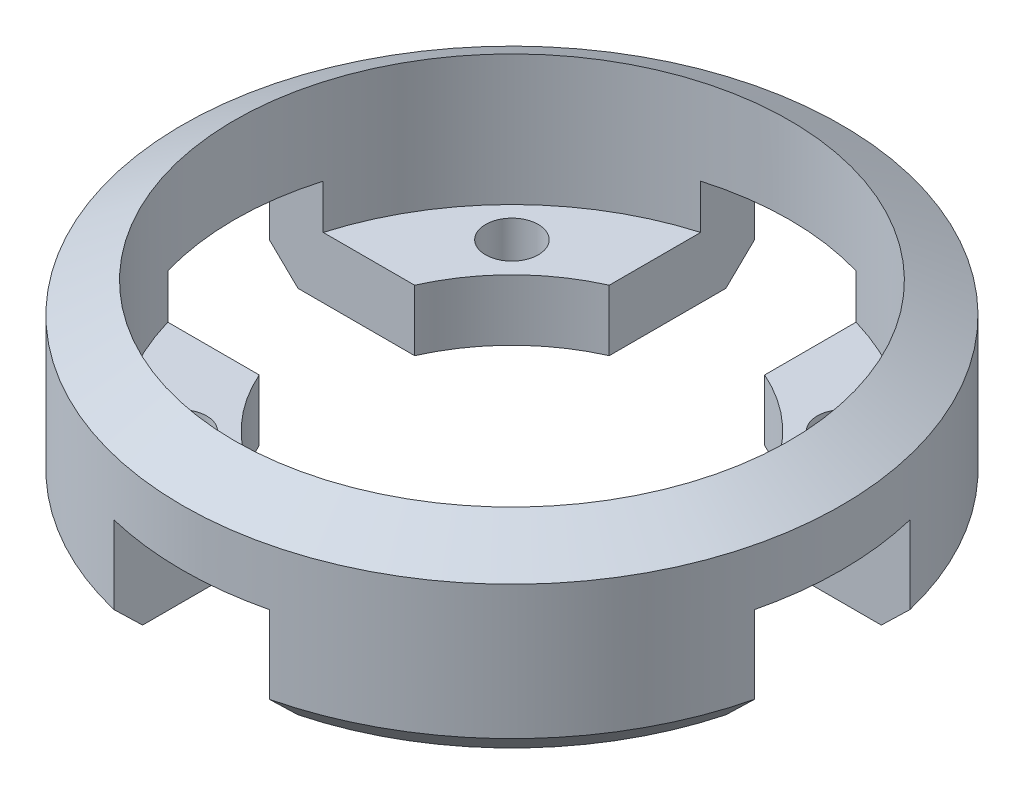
ISO-10303-21;
HEADER;
FILE_DESCRIPTION(('STEP AP214'),'2;1');
FILE_NAME('part.step','',(''),(''),'','','');
FILE_SCHEMA(('AUTOMOTIVE_DESIGN { 1 0 10303 214 1 1 1 1 }'));
ENDSEC;
DATA;
#1=APPLICATION_CONTEXT('core data for automotive mechanical design processes');
#2=APPLICATION_PROTOCOL_DEFINITION('international standard','automotive_design',2000,#1);
#3=PRODUCT_CONTEXT('',#1,'mechanical');
#4=PRODUCT('Part','Part','',(#3));
#5=PRODUCT_RELATED_PRODUCT_CATEGORY('part','',(#4));
#6=PRODUCT_DEFINITION_FORMATION('','',#4);
#7=PRODUCT_DEFINITION_CONTEXT('part definition',#1,'design');
#8=PRODUCT_DEFINITION('design','',#6,#7);
#9=PRODUCT_DEFINITION_SHAPE('','',#8);
#10=(LENGTH_UNIT() NAMED_UNIT(*) SI_UNIT(.MILLI.,.METRE.));
#11=(NAMED_UNIT(*) PLANE_ANGLE_UNIT() SI_UNIT($,.RADIAN.));
#12=(NAMED_UNIT(*) SI_UNIT($,.STERADIAN.) SOLID_ANGLE_UNIT());
#13=UNCERTAINTY_MEASURE_WITH_UNIT(LENGTH_MEASURE(1.E-05),#10,'distance_accuracy_value','');
#14=(GEOMETRIC_REPRESENTATION_CONTEXT(3) GLOBAL_UNCERTAINTY_ASSIGNED_CONTEXT((#13)) GLOBAL_UNIT_ASSIGNED_CONTEXT((#10,
#11,#12)) REPRESENTATION_CONTEXT('',''));
#15=CARTESIAN_POINT('',(0.,0.,0.));
#16=DIRECTION('',(0.,0.,1.));
#17=DIRECTION('',(1.,0.,0.));
#18=AXIS2_PLACEMENT_3D('',#15,#16,#17);
#19=CARTESIAN_POINT('',(0.,0.,0.));
#20=DIRECTION('',(0.,-1.,0.));
#21=DIRECTION('',(0.,0.,-1.));
#22=AXIS2_PLACEMENT_3D('',#19,#20,#21);
#23=PLANE('',#22);
#24=DIRECTION('',(1.,0.,0.));
#25=VECTOR('',#24,1.);
#26=CARTESIAN_POINT('',(60.325,0.,-14.224));
#27=LINE('',#26,#25);
#28=CARTESIAN_POINT('',(32.0362377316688,0.,-14.224));
#29=VERTEX_POINT('',#28);
#30=CARTESIAN_POINT('',(53.3824676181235,0.,-14.224));
#31=VERTEX_POINT('',#30);
#32=EDGE_CURVE('E524',#29,#31,#27,.T.);
#33=ORIENTED_EDGE('',*,*,#32,.F.);
#34=CARTESIAN_POINT('',(0.,0.,0.));
#35=DIRECTION('',(0.,-1.,0.));
#36=DIRECTION('',(0.,0.,-1.));
#37=AXIS2_PLACEMENT_3D('',#34,#35,#36);
#38=CIRCLE('',#37,35.052);
#39=CARTESIAN_POINT('',(14.224,0.,-32.0362377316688));
#40=VERTEX_POINT('',#39);
#41=EDGE_CURVE('E285',#40,#29,#38,.T.);
#42=ORIENTED_EDGE('',*,*,#41,.F.);
#43=DIRECTION('',(0.,0.,1.));
#44=VECTOR('',#43,1.);
#45=CARTESIAN_POINT('',(14.224,0.,-14.224));
#46=LINE('',#45,#44);
#47=CARTESIAN_POINT('',(14.224,0.,-53.3824676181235));
#48=VERTEX_POINT('',#47);
#49=EDGE_CURVE('E544',#48,#40,#46,.T.);
#50=ORIENTED_EDGE('',*,*,#49,.F.);
#51=CARTESIAN_POINT('',(0.,0.,0.));
#52=DIRECTION('',(0.,1.,0.));
#53=DIRECTION('',(0.,0.,1.));
#54=AXIS2_PLACEMENT_3D('',#51,#52,#53);
#55=CIRCLE('',#54,55.245);
#56=EDGE_CURVE('E244',#31,#48,#55,.T.);
#57=ORIENTED_EDGE('',*,*,#56,.F.);
#58=EDGE_LOOP('',(#33,#42,#50,#57));
#59=FACE_BOUND('',#58,.T.);
#60=CARTESIAN_POINT('',(30.353265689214,0.,-30.3532656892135));
#61=DIRECTION('',(0.,1.,0.));
#62=DIRECTION('',(0.,0.,1.));
#63=AXIS2_PLACEMENT_3D('',#60,#61,#62);
#64=CIRCLE('',#63,4.826);
#65=CARTESIAN_POINT('',(30.353265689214,0.,-25.5272656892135));
#66=VERTEX_POINT('',#65);
#67=EDGE_CURVE('E633',#66,#66,#64,.T.);
#68=ORIENTED_EDGE('',*,*,#67,.T.);
#69=EDGE_LOOP('',(#68));
#70=FACE_BOUND('',#69,.T.);
#71=ADVANCED_FACE('F33',(#59,#70),#23,.T.);
#72=CARTESIAN_POINT('',(-50.8,11.176,0.));
#73=DIRECTION('',(0.,1.,0.));
#74=DIRECTION('',(0.,0.,1.));
#75=AXIS2_PLACEMENT_3D('',#72,#73,#74);
#76=PLANE('',#75);
#77=DIRECTION('',(-1.,0.,0.));
#78=VECTOR('',#77,1.);
#79=CARTESIAN_POINT('',(-50.8,11.176,-14.224));
#80=LINE('',#79,#78);
#81=CARTESIAN_POINT('',(48.768,11.176,-14.224));
#82=VERTEX_POINT('',#81);
#83=CARTESIAN_POINT('',(32.0362377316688,11.176,-14.224));
#84=VERTEX_POINT('',#83);
#85=EDGE_CURVE('E329',#82,#84,#80,.T.);
#86=ORIENTED_EDGE('',*,*,#85,.F.);
#87=CARTESIAN_POINT('',(0.,11.176,0.));
#88=DIRECTION('',(0.,1.,0.));
#89=DIRECTION('',(0.,0.,1.));
#90=AXIS2_PLACEMENT_3D('',#87,#88,#89);
#91=CIRCLE('',#90,50.8);
#92=CARTESIAN_POINT('',(14.224,11.176,-48.768));
#93=VERTEX_POINT('',#92);
#94=EDGE_CURVE('E283',#82,#93,#91,.T.);
#95=ORIENTED_EDGE('',*,*,#94,.T.);
#96=DIRECTION('',(0.,0.,-1.));
#97=VECTOR('',#96,1.);
#98=CARTESIAN_POINT('',(14.224,11.176,0.));
#99=LINE('',#98,#97);
#100=CARTESIAN_POINT('',(14.224,11.176,-32.0362377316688));
#101=VERTEX_POINT('',#100);
#102=EDGE_CURVE('E570',#101,#93,#99,.T.);
#103=ORIENTED_EDGE('',*,*,#102,.F.);
#104=CARTESIAN_POINT('',(0.,11.176,0.));
#105=DIRECTION('',(0.,1.,0.));
#106=DIRECTION('',(0.,0.,1.));
#107=AXIS2_PLACEMENT_3D('',#104,#105,#106);
#108=CIRCLE('',#107,35.052);
#109=EDGE_CURVE('E419',#84,#101,#108,.T.);
#110=ORIENTED_EDGE('',*,*,#109,.F.);
#111=EDGE_LOOP('',(#86,#95,#103,#110));
#112=FACE_BOUND('',#111,.T.);
#113=CARTESIAN_POINT('',(30.353265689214,11.176,-30.3532656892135));
#114=DIRECTION('',(0.,1.,0.));
#115=DIRECTION('',(0.,0.,1.));
#116=AXIS2_PLACEMENT_3D('',#113,#114,#115);
#117=CIRCLE('',#116,4.826);
#118=CARTESIAN_POINT('',(30.353265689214,11.176,-25.5272656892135));
#119=VERTEX_POINT('',#118);
#120=EDGE_CURVE('E37',#119,#119,#117,.F.);
#121=ORIENTED_EDGE('',*,*,#120,.T.);
#122=EDGE_LOOP('',(#121));
#123=FACE_BOUND('',#122,.T.);
#124=ADVANCED_FACE('F474',(#112,#123),#76,.T.);
#125=DIRECTION('',(0.,0.,-1.));
#126=VECTOR('',#125,1.);
#127=CARTESIAN_POINT('',(-14.224,0.,-14.224));
#128=LINE('',#127,#126);
#129=CARTESIAN_POINT('',(-14.224,0.,-32.0362377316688));
#130=VERTEX_POINT('',#129);
#131=CARTESIAN_POINT('',(-14.224,0.,-53.3824676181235));
#132=VERTEX_POINT('',#131);
#133=EDGE_CURVE('E542',#130,#132,#128,.T.);
#134=ORIENTED_EDGE('',*,*,#133,.F.);
#135=CARTESIAN_POINT('',(-32.0362377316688,0.,-14.224));
#136=VERTEX_POINT('',#135);
#137=EDGE_CURVE('E289',#136,#130,#38,.T.);
#138=ORIENTED_EDGE('',*,*,#137,.F.);
#139=DIRECTION('',(1.,0.,0.));
#140=VECTOR('',#139,1.);
#141=CARTESIAN_POINT('',(-14.224,0.,-14.224));
#142=LINE('',#141,#140);
#143=CARTESIAN_POINT('',(-53.3824676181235,0.,-14.224));
#144=VERTEX_POINT('',#143);
#145=EDGE_CURVE('E540',#144,#136,#142,.T.);
#146=ORIENTED_EDGE('',*,*,#145,.F.);
#147=EDGE_CURVE('E250',#132,#144,#55,.T.);
#148=ORIENTED_EDGE('',*,*,#147,.F.);
#149=EDGE_LOOP('',(#134,#138,#146,#148));
#150=FACE_BOUND('',#149,.T.);
#151=CARTESIAN_POINT('',(-30.3532656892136,0.,-30.3532656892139));
#152=DIRECTION('',(0.,1.,0.));
#153=DIRECTION('',(0.,0.,1.));
#154=AXIS2_PLACEMENT_3D('',#151,#152,#153);
#155=CIRCLE('',#154,4.826);
#156=CARTESIAN_POINT('',(-30.3532656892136,0.,-25.5272656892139));
#157=VERTEX_POINT('',#156);
#158=EDGE_CURVE('E516',#157,#157,#155,.T.);
#159=ORIENTED_EDGE('',*,*,#158,.T.);
#160=EDGE_LOOP('',(#159));
#161=FACE_BOUND('',#160,.T.);
#162=ADVANCED_FACE('F476',(#150,#161),#23,.T.);
#163=DIRECTION('',(0.,0.,1.));
#164=VECTOR('',#163,1.);
#165=CARTESIAN_POINT('',(-14.224,11.176,0.));
#166=LINE('',#165,#164);
#167=CARTESIAN_POINT('',(-14.224,11.176,-48.768));
#168=VERTEX_POINT('',#167);
#169=CARTESIAN_POINT('',(-14.224,11.176,-32.0362377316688));
#170=VERTEX_POINT('',#169);
#171=EDGE_CURVE('E441',#168,#170,#166,.T.);
#172=ORIENTED_EDGE('',*,*,#171,.F.);
#173=CARTESIAN_POINT('',(-48.768,11.176,-14.224));
#174=VERTEX_POINT('',#173);
#175=EDGE_CURVE('E415',#168,#174,#91,.T.);
#176=ORIENTED_EDGE('',*,*,#175,.T.);
#177=DIRECTION('',(-1.,0.,0.));
#178=VECTOR('',#177,1.);
#179=CARTESIAN_POINT('',(-50.8,11.176,-14.224));
#180=LINE('',#179,#178);
#181=CARTESIAN_POINT('',(-32.0362377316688,11.176,-14.224));
#182=VERTEX_POINT('',#181);
#183=EDGE_CURVE('E443',#182,#174,#180,.T.);
#184=ORIENTED_EDGE('',*,*,#183,.F.);
#185=EDGE_CURVE('E424',#170,#182,#108,.T.);
#186=ORIENTED_EDGE('',*,*,#185,.F.);
#187=EDGE_LOOP('',(#172,#176,#184,#186));
#188=FACE_BOUND('',#187,.T.);
#189=CARTESIAN_POINT('',(-30.3532656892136,11.176,-30.3532656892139));
#190=DIRECTION('',(0.,1.,0.));
#191=DIRECTION('',(0.,0.,1.));
#192=AXIS2_PLACEMENT_3D('',#189,#190,#191);
#193=CIRCLE('',#192,4.826);
#194=CARTESIAN_POINT('',(-30.3532656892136,11.176,-25.5272656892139));
#195=VERTEX_POINT('',#194);
#196=EDGE_CURVE('E510',#195,#195,#193,.F.);
#197=ORIENTED_EDGE('',*,*,#196,.T.);
#198=EDGE_LOOP('',(#197));
#199=FACE_BOUND('',#198,.T.);
#200=ADVANCED_FACE('F439',(#188,#199),#76,.T.);
#201=DIRECTION('',(-1.,0.,0.));
#202=VECTOR('',#201,1.);
#203=CARTESIAN_POINT('',(-14.224,0.,14.224));
#204=LINE('',#203,#202);
#205=CARTESIAN_POINT('',(-32.0362377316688,0.,14.224));
#206=VERTEX_POINT('',#205);
#207=CARTESIAN_POINT('',(-53.3824676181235,0.,14.224));
#208=VERTEX_POINT('',#207);
#209=EDGE_CURVE('E503',#206,#208,#204,.T.);
#210=ORIENTED_EDGE('',*,*,#209,.F.);
#211=CARTESIAN_POINT('',(-14.224,0.,32.0362377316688));
#212=VERTEX_POINT('',#211);
#213=EDGE_CURVE('E557',#212,#206,#38,.T.);
#214=ORIENTED_EDGE('',*,*,#213,.F.);
#215=DIRECTION('',(0.,0.,-1.));
#216=VECTOR('',#215,1.);
#217=CARTESIAN_POINT('',(-14.224,0.,60.325));
#218=LINE('',#217,#216);
#219=CARTESIAN_POINT('',(-14.224,0.,53.3824676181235));
#220=VERTEX_POINT('',#219);
#221=EDGE_CURVE('E537',#220,#212,#218,.T.);
#222=ORIENTED_EDGE('',*,*,#221,.F.);
#223=EDGE_CURVE('E246',#208,#220,#55,.T.);
#224=ORIENTED_EDGE('',*,*,#223,.F.);
#225=EDGE_LOOP('',(#210,#214,#222,#224));
#226=FACE_BOUND('',#225,.T.);
#227=CARTESIAN_POINT('',(-30.3532656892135,0.,30.353265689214));
#228=DIRECTION('',(0.,1.,0.));
#229=DIRECTION('',(0.,0.,1.));
#230=AXIS2_PLACEMENT_3D('',#227,#228,#229);
#231=CIRCLE('',#230,4.82599999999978);
#232=CARTESIAN_POINT('',(-30.3532656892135,0.,35.1792656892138));
#233=VERTEX_POINT('',#232);
#234=EDGE_CURVE('E507',#233,#233,#231,.T.);
#235=ORIENTED_EDGE('',*,*,#234,.T.);
#236=EDGE_LOOP('',(#235));
#237=FACE_BOUND('',#236,.T.);
#238=ADVANCED_FACE('F487',(#226,#237),#23,.T.);
#239=DIRECTION('',(1.,0.,0.));
#240=VECTOR('',#239,1.);
#241=CARTESIAN_POINT('',(-50.8,11.176,14.224));
#242=LINE('',#241,#240);
#243=CARTESIAN_POINT('',(-48.768,11.176,14.224));
#244=VERTEX_POINT('',#243);
#245=CARTESIAN_POINT('',(-32.0362377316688,11.176,14.224));
#246=VERTEX_POINT('',#245);
#247=EDGE_CURVE('E59',#244,#246,#242,.T.);
#248=ORIENTED_EDGE('',*,*,#247,.F.);
#249=CARTESIAN_POINT('',(-14.224,11.176,48.768));
#250=VERTEX_POINT('',#249);
#251=EDGE_CURVE('E284',#244,#250,#91,.T.);
#252=ORIENTED_EDGE('',*,*,#251,.T.);
#253=DIRECTION('',(0.,0.,1.));
#254=VECTOR('',#253,1.);
#255=CARTESIAN_POINT('',(-14.224,11.176,0.));
#256=LINE('',#255,#254);
#257=CARTESIAN_POINT('',(-14.224,11.176,32.0362377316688));
#258=VERTEX_POINT('',#257);
#259=EDGE_CURVE('E371',#258,#250,#256,.T.);
#260=ORIENTED_EDGE('',*,*,#259,.F.);
#261=EDGE_CURVE('E288',#246,#258,#108,.T.);
#262=ORIENTED_EDGE('',*,*,#261,.F.);
#263=EDGE_LOOP('',(#248,#252,#260,#262));
#264=FACE_BOUND('',#263,.T.);
#265=CARTESIAN_POINT('',(-30.3532656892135,11.176,30.353265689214));
#266=DIRECTION('',(0.,1.,0.));
#267=DIRECTION('',(0.,0.,1.));
#268=AXIS2_PLACEMENT_3D('',#265,#266,#267);
#269=CIRCLE('',#268,4.82599999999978);
#270=CARTESIAN_POINT('',(-30.3532656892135,11.176,35.1792656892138));
#271=VERTEX_POINT('',#270);
#272=EDGE_CURVE('E509',#271,#271,#269,.F.);
#273=ORIENTED_EDGE('',*,*,#272,.T.);
#274=EDGE_LOOP('',(#273));
#275=FACE_BOUND('',#274,.T.);
#276=ADVANCED_FACE('F413',(#264,#275),#76,.T.);
#277=DIRECTION('',(0.,0.,1.));
#278=VECTOR('',#277,1.);
#279=CARTESIAN_POINT('',(14.224,0.,60.325));
#280=LINE('',#279,#278);
#281=CARTESIAN_POINT('',(14.224,0.,32.0362377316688));
#282=VERTEX_POINT('',#281);
#283=CARTESIAN_POINT('',(14.224,0.,53.3824676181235));
#284=VERTEX_POINT('',#283);
#285=EDGE_CURVE('E237',#282,#284,#280,.T.);
#286=ORIENTED_EDGE('',*,*,#285,.F.);
#287=CARTESIAN_POINT('',(32.0362377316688,0.,14.224));
#288=VERTEX_POINT('',#287);
#289=EDGE_CURVE('E236',#288,#282,#38,.T.);
#290=ORIENTED_EDGE('',*,*,#289,.F.);
#291=DIRECTION('',(-1.,0.,0.));
#292=VECTOR('',#291,1.);
#293=CARTESIAN_POINT('',(60.325,0.,14.224));
#294=LINE('',#293,#292);
#295=CARTESIAN_POINT('',(53.3824676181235,0.,14.224));
#296=VERTEX_POINT('',#295);
#297=EDGE_CURVE('E51',#296,#288,#294,.T.);
#298=ORIENTED_EDGE('',*,*,#297,.F.);
#299=EDGE_CURVE('E234',#284,#296,#55,.T.);
#300=ORIENTED_EDGE('',*,*,#299,.F.);
#301=EDGE_LOOP('',(#286,#290,#298,#300));
#302=FACE_BOUND('',#301,.T.);
#303=CARTESIAN_POINT('',(30.3532656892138,0.,30.3532656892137));
#304=DIRECTION('',(0.,1.,0.));
#305=DIRECTION('',(0.,0.,1.));
#306=AXIS2_PLACEMENT_3D('',#303,#304,#305);
#307=CIRCLE('',#306,4.82600000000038);
#308=CARTESIAN_POINT('',(30.3532656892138,0.,35.1792656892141));
#309=VERTEX_POINT('',#308);
#310=EDGE_CURVE('E513',#309,#309,#307,.T.);
#311=ORIENTED_EDGE('',*,*,#310,.T.);
#312=EDGE_LOOP('',(#311));
#313=FACE_BOUND('',#312,.T.);
#314=ADVANCED_FACE('F35',(#302,#313),#23,.T.);
#315=DIRECTION('',(0.,0.,-1.));
#316=VECTOR('',#315,1.);
#317=CARTESIAN_POINT('',(14.224,11.176,0.));
#318=LINE('',#317,#316);
#319=CARTESIAN_POINT('',(14.224,11.176,48.768));
#320=VERTEX_POINT('',#319);
#321=CARTESIAN_POINT('',(14.224,11.176,32.0362377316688));
#322=VERTEX_POINT('',#321);
#323=EDGE_CURVE('E227',#320,#322,#318,.T.);
#324=ORIENTED_EDGE('',*,*,#323,.F.);
#325=CARTESIAN_POINT('',(48.768,11.176,14.224));
#326=VERTEX_POINT('',#325);
#327=EDGE_CURVE('E278',#320,#326,#91,.T.);
#328=ORIENTED_EDGE('',*,*,#327,.T.);
#329=DIRECTION('',(1.,0.,0.));
#330=VECTOR('',#329,1.);
#331=CARTESIAN_POINT('',(-50.8,11.176,14.224));
#332=LINE('',#331,#330);
#333=CARTESIAN_POINT('',(32.0362377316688,11.176,14.224));
#334=VERTEX_POINT('',#333);
#335=EDGE_CURVE('E346',#334,#326,#332,.T.);
#336=ORIENTED_EDGE('',*,*,#335,.F.);
#337=EDGE_CURVE('E416',#322,#334,#108,.T.);
#338=ORIENTED_EDGE('',*,*,#337,.F.);
#339=EDGE_LOOP('',(#324,#328,#336,#338));
#340=FACE_BOUND('',#339,.T.);
#341=CARTESIAN_POINT('',(30.3532656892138,11.176,30.3532656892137));
#342=DIRECTION('',(0.,1.,0.));
#343=DIRECTION('',(0.,0.,1.));
#344=AXIS2_PLACEMENT_3D('',#341,#342,#343);
#345=CIRCLE('',#344,4.82600000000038);
#346=CARTESIAN_POINT('',(30.3532656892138,11.176,35.1792656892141));
#347=VERTEX_POINT('',#346);
#348=EDGE_CURVE('E238',#347,#347,#345,.F.);
#349=ORIENTED_EDGE('',*,*,#348,.T.);
#350=EDGE_LOOP('',(#349));
#351=FACE_BOUND('',#350,.T.);
#352=ADVANCED_FACE('F482',(#340,#351),#76,.T.);
#353=CARTESIAN_POINT('',(0.,5.07999999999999,0.));
#354=DIRECTION('',(0.,1.,0.));
#355=DIRECTION('',(0.,0.,1.));
#356=AXIS2_PLACEMENT_3D('',#353,#354,#355);
#357=CONICAL_SURFACE('',#356,60.325,0.785398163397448);
#358=CARTESIAN_POINT('',(24.1100227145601,-27.251869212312,-14.224));
#359=CARTESIAN_POINT('',(24.6282055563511,-26.8055300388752,-14.224));
#360=CARTESIAN_POINT('',(25.1445836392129,-26.3571043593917,-14.224));
#361=CARTESIAN_POINT('',(26.1741682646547,-25.4566397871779,-14.224));
#362=CARTESIAN_POINT('',(26.6873748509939,-25.0046009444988,-14.224));
#363=CARTESIAN_POINT('',(27.7110416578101,-24.0974814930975,-14.224));
#364=CARTESIAN_POINT('',(28.2215020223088,-23.6424010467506,-14.224));
#365=CARTESIAN_POINT('',(29.240051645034,-22.7295917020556,-14.224));
#366=CARTESIAN_POINT('',(29.7481408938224,-22.2718627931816,-14.224));
#367=CARTESIAN_POINT('',(31.2691764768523,-20.8953722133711,-14.224));
#368=CARTESIAN_POINT('',(32.279025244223,-19.9731870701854,-14.224));
#369=CARTESIAN_POINT('',(34.2923207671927,-18.1218351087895,-14.224));
#370=CARTESIAN_POINT('',(35.2957674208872,-17.1926681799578,-14.224));
#371=CARTESIAN_POINT('',(37.2973687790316,-15.3290554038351,-14.224));
#372=CARTESIAN_POINT('',(38.2955245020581,-14.3946106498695,-14.224));
#373=CARTESIAN_POINT('',(40.2877312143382,-12.5213695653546,-14.224));
#374=CARTESIAN_POINT('',(41.2817822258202,-11.5825732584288,-14.224));
#375=CARTESIAN_POINT('',(43.2665647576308,-9.70141975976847,-14.224));
#376=CARTESIAN_POINT('',(44.257296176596,-8.75906246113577,-14.224));
#377=CARTESIAN_POINT('',(46.2359896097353,-6.87144420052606,-14.224));
#378=CARTESIAN_POINT('',(47.2239516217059,-5.9261832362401,-14.224));
#379=CARTESIAN_POINT('',(48.7997544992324,-4.41478745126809,-14.224));
#380=CARTESIAN_POINT('',(49.3883418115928,-3.84943049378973,-14.224));
#381=CARTESIAN_POINT('',(50.5647647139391,-2.71794344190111,-14.224));
#382=CARTESIAN_POINT('',(51.1526003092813,-2.15181335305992,-14.224));
#383=CARTESIAN_POINT('',(52.9151340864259,-0.4523315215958,-14.224));
#384=CARTESIAN_POINT('',(54.0888179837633,0.682072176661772,-14.224));
#385=CARTESIAN_POINT('',(57.2626681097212,3.75572631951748,-14.224));
#386=CARTESIAN_POINT('',(59.2607042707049,5.69717589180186,-14.224));
#387=CARTESIAN_POINT('',(63.2519678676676,9.58501315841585,-14.224));
#388=CARTESIAN_POINT('',(65.2451952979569,11.5314008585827,-14.224));
#389=CARTESIAN_POINT('',(69.2279791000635,15.4279473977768,-14.224));
#390=CARTESIAN_POINT('',(71.2175354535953,17.3781062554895,-14.224));
#391=CARTESIAN_POINT('',(75.1937751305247,21.2813509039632,-14.224));
#392=CARTESIAN_POINT('',(77.1804584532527,23.2344366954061,-14.224));
#393=CARTESIAN_POINT('',(81.1511209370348,27.1425199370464,-14.224));
#394=CARTESIAN_POINT('',(83.1351005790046,29.0975168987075,-14.224));
#395=CARTESIAN_POINT('',(87.1012115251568,33.0093853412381,-14.224));
#396=CARTESIAN_POINT('',(89.0833428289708,34.966256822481,-14.224));
#397=CARTESIAN_POINT('',(93.046063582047,38.8815021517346,-14.224));
#398=CARTESIAN_POINT('',(95.0266530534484,40.8398759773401,-14.224));
#399=CARTESIAN_POINT('',(98.9865641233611,44.7579032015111,-14.224));
#400=CARTESIAN_POINT('',(100.965885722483,46.7175565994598,-14.224));
#401=CARTESIAN_POINT('',(102.944696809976,48.6777250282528,-14.224));
#402=B_SPLINE_CURVE_WITH_KNOTS('',3,(#358,#359,#360,#361,#362,#363,#364,#365,#366,#367,#368,
#369,#370,#371,#372,#373,#374,#375,#376,#377,#378,#379,#380,#381,#382,#383,#384,#385,#386,#387,
#388,#389,#390,#391,#392,#393,#394,#395,#396,#397,#398,#399,#400,#401),.UNSPECIFIED.,.F.,.F.,(4,
2,2,2,2,2,2,2,2,2,2,2,2,2,2,2,2,2,2,2,2,4),(0.,2.05171444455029,4.1034005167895,
6.15497792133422,8.20656348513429,12.3091944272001,16.4118905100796,20.5137657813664,
24.6156188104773,28.7175959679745,32.8195763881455,35.2679571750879,37.7163204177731,
42.6132185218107,50.9709791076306,59.3287495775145,67.6865615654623,76.0443755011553,
84.4004313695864,92.7564889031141,101.112424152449,109.468355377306),.UNSPECIFIED.);
#403=CARTESIAN_POINT('',(58.6240859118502,5.07999999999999,-14.224));
#404=VERTEX_POINT('',#403);
#405=EDGE_CURVE('E294',#31,#404,#402,.T.);
#406=ORIENTED_EDGE('',*,*,#405,.F.);
#407=ORIENTED_EDGE('',*,*,#56,.T.);
#408=CARTESIAN_POINT('',(14.224,48.6777250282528,-102.944696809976));
#409=CARTESIAN_POINT('',(14.224,46.7171108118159,-100.965435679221));
#410=CARTESIAN_POINT('',(14.224,44.7570118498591,-98.9856638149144));
#411=CARTESIAN_POINT('',(14.224,40.838094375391,-95.0248518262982));
#412=CARTESIAN_POINT('',(14.224,38.8792758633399,-93.0438117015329));
#413=CARTESIAN_POINT('',(14.224,34.963199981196,-89.0802475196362));
#414=CARTESIAN_POINT('',(14.224,33.0059425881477,-87.0977234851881));
#415=CARTESIAN_POINT('',(14.224,29.0933030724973,-83.1308258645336));
#416=CARTESIAN_POINT('',(14.224,27.137920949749,-81.1464522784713));
#417=CARTESIAN_POINT('',(14.224,23.2298974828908,-77.1758425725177));
#418=CARTESIAN_POINT('',(14.224,21.2772556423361,-75.1896069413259));
#419=CARTESIAN_POINT('',(14.224,17.3748980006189,-71.2142635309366));
#420=CARTESIAN_POINT('',(14.224,15.4251821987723,-69.2251557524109));
#421=CARTESIAN_POINT('',(14.224,11.5294680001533,-65.2432166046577));
#422=CARTESIAN_POINT('',(14.224,9.58346968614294,-63.25038515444));
#423=CARTESIAN_POINT('',(14.224,5.69640675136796,-59.2599128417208));
#424=CARTESIAN_POINT('',(14.224,3.75534213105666,-57.2622719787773));
#425=CARTESIAN_POINT('',(14.224,0.582548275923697,-53.9860493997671));
#426=CARTESIAN_POINT('',(14.224,-0.651168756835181,-52.7093930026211));
#427=CARTESIAN_POINT('',(14.224,-3.11523144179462,-50.1528354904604));
#428=CARTESIAN_POINT('',(14.224,-4.34557710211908,-48.8729343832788));
#429=CARTESIAN_POINT('',(14.224,-6.80198666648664,-46.3091591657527));
#430=CARTESIAN_POINT('',(14.224,-8.02805079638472,-45.0252852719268));
#431=CARTESIAN_POINT('',(14.224,-10.4748050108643,-42.4524032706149));
#432=CARTESIAN_POINT('',(14.224,-11.6954950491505,-41.163395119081));
#433=CARTESIAN_POINT('',(14.224,-14.1301053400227,-38.5785126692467));
#434=CARTESIAN_POINT('',(14.224,-15.3440242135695,-37.2826370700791));
#435=CARTESIAN_POINT('',(14.224,-17.1578131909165,-35.3322563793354));
#436=CARTESIAN_POINT('',(14.224,-17.7612217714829,-34.6810416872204));
#437=CARTESIAN_POINT('',(14.224,-18.9652611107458,-33.3760501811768));
#438=CARTESIAN_POINT('',(14.224,-19.5658918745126,-32.7222733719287));
#439=CARTESIAN_POINT('',(14.224,-20.7639815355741,-31.4116073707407));
#440=CARTESIAN_POINT('',(14.224,-21.3614398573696,-30.7547176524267));
#441=CARTESIAN_POINT('',(14.224,-22.552438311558,-29.4374022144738));
#442=CARTESIAN_POINT('',(14.224,-23.1459784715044,-28.7769765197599));
#443=CARTESIAN_POINT('',(14.224,-24.3283864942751,-27.4518555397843));
#444=CARTESIAN_POINT('',(14.224,-24.9172539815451,-26.7871599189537));
#445=CARTESIAN_POINT('',(14.224,-25.7962279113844,-25.7863027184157));
#446=CARTESIAN_POINT('',(14.224,-26.0885015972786,-25.4520438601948));
#447=CARTESIAN_POINT('',(14.224,-26.6714369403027,-24.7821207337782));
#448=CARTESIAN_POINT('',(14.224,-26.9620985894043,-24.4464564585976));
#449=CARTESIAN_POINT('',(14.224,-27.2518692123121,-24.1100227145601));
#450=B_SPLINE_CURVE_WITH_KNOTS('',3,(#408,#409,#410,#411,#412,#413,#414,#415,#416,#417,#418,
#419,#420,#421,#422,#423,#424,#425,#426,#427,#428,#429,#430,#431,#432,#433,#434,#435,#436,#437,
#438,#439,#440,#441,#442,#443,#444,#445,#446,#447,#448,#449),.UNSPECIFIED.,.F.,.F.,(4,2,2,2,2,2,
2,2,2,2,2,2,2,2,2,2,2,2,2,2,4),(0.,8.35783159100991,16.7156661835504,25.073375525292,
33.4310842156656,41.787006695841,50.1429272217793,58.4990316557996,66.855136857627,
72.1812172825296,77.50728486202,82.8330671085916,88.1588951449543,93.4857709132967,
96.1491538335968,98.812531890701,101.476377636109,104.140204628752,106.804243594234,
108.136296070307,109.468355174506),.UNSPECIFIED.);
#451=CARTESIAN_POINT('',(14.224,5.07999999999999,-58.6240859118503));
#452=VERTEX_POINT('',#451);
#453=EDGE_CURVE('E323',#452,#48,#450,.T.);
#454=ORIENTED_EDGE('',*,*,#453,.F.);
#455=CARTESIAN_POINT('',(0.,5.07999999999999,0.));
#456=DIRECTION('',(0.,1.,0.));
#457=DIRECTION('',(0.,0.,1.));
#458=AXIS2_PLACEMENT_3D('',#455,#456,#457);
#459=CIRCLE('',#458,60.325);
#460=EDGE_CURVE('E260',#404,#452,#459,.T.);
#461=ORIENTED_EDGE('',*,*,#460,.F.);
#462=EDGE_LOOP('',(#406,#407,#454,#461));
#463=FACE_BOUND('',#462,.T.);
#464=ADVANCED_FACE('F493',(#463),#357,.T.);
#465=CARTESIAN_POINT('',(-14.224,-27.2518692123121,-24.1100227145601));
#466=CARTESIAN_POINT('',(-14.224,-26.8055300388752,-24.6282055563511));
#467=CARTESIAN_POINT('',(-14.224,-26.3571043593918,-25.1445836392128));
#468=CARTESIAN_POINT('',(-14.224,-25.4566397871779,-26.1741682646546));
#469=CARTESIAN_POINT('',(-14.224,-25.0046009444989,-26.6873748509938));
#470=CARTESIAN_POINT('',(-14.224,-24.0974814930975,-27.71104165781));
#471=CARTESIAN_POINT('',(-14.224,-23.6424010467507,-28.2215020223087));
#472=CARTESIAN_POINT('',(-14.224,-22.7295917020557,-29.240051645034));
#473=CARTESIAN_POINT('',(-14.224,-22.2718627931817,-29.7481408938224));
#474=CARTESIAN_POINT('',(-14.224,-20.8953722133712,-31.2691764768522));
#475=CARTESIAN_POINT('',(-14.224,-19.9731870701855,-32.2790252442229));
#476=CARTESIAN_POINT('',(-14.224,-18.1218351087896,-34.2923207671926));
#477=CARTESIAN_POINT('',(-14.224,-17.1926681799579,-35.2957674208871));
#478=CARTESIAN_POINT('',(-14.224,-15.3290554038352,-37.2973687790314));
#479=CARTESIAN_POINT('',(-14.224,-14.3946106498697,-38.2955245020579));
#480=CARTESIAN_POINT('',(-14.224,-12.5213695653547,-40.2877312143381));
#481=CARTESIAN_POINT('',(-14.224,-11.5825732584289,-41.2817822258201));
#482=CARTESIAN_POINT('',(-14.224,-9.70141975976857,-43.2665647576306));
#483=CARTESIAN_POINT('',(-14.224,-8.75906246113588,-44.2572961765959));
#484=CARTESIAN_POINT('',(-14.224,-6.87144420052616,-46.2359896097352));
#485=CARTESIAN_POINT('',(-14.224,-5.92618323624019,-47.2239516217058));
#486=CARTESIAN_POINT('',(-14.224,-4.41478745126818,-48.7997544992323));
#487=CARTESIAN_POINT('',(-14.224,-3.8494304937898,-49.3883418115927));
#488=CARTESIAN_POINT('',(-14.224,-2.71794344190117,-50.564764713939));
#489=CARTESIAN_POINT('',(-14.224,-2.15181335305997,-51.1526003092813));
#490=CARTESIAN_POINT('',(-14.224,-0.452331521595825,-52.9151340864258));
#491=CARTESIAN_POINT('',(-14.224,0.682072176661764,-54.0888179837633));
#492=CARTESIAN_POINT('',(-14.224,3.75572631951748,-57.2626681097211));
#493=CARTESIAN_POINT('',(-14.224,5.69717589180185,-59.2607042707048));
#494=CARTESIAN_POINT('',(-14.224,9.58501315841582,-63.2519678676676));
#495=CARTESIAN_POINT('',(-14.224,11.5314008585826,-65.2451952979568));
#496=CARTESIAN_POINT('',(-14.224,15.4279473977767,-69.2279791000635));
#497=CARTESIAN_POINT('',(-14.224,17.3781062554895,-71.2175354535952));
#498=CARTESIAN_POINT('',(-14.224,21.2813509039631,-75.1937751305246));
#499=CARTESIAN_POINT('',(-14.224,23.234436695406,-77.1804584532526));
#500=CARTESIAN_POINT('',(-14.224,27.1425199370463,-81.1511209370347));
#501=CARTESIAN_POINT('',(-14.224,29.0975168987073,-83.1351005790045));
#502=CARTESIAN_POINT('',(-14.224,33.009385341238,-87.1012115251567));
#503=CARTESIAN_POINT('',(-14.224,34.9662568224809,-89.0833428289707));
#504=CARTESIAN_POINT('',(-14.224,38.8815021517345,-93.0460635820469));
#505=CARTESIAN_POINT('',(-14.224,40.8398759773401,-95.0266530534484));
#506=CARTESIAN_POINT('',(-14.224,44.7579032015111,-98.9865641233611));
#507=CARTESIAN_POINT('',(-14.224,46.7175565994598,-100.965885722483));
#508=CARTESIAN_POINT('',(-14.224,48.6777250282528,-102.944696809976));
#509=B_SPLINE_CURVE_WITH_KNOTS('',3,(#465,#466,#467,#468,#469,#470,#471,#472,#473,#474,#475,
#476,#477,#478,#479,#480,#481,#482,#483,#484,#485,#486,#487,#488,#489,#490,#491,#492,#493,#494,
#495,#496,#497,#498,#499,#500,#501,#502,#503,#504,#505,#506,#507,#508),.UNSPECIFIED.,.F.,.F.,(4,
2,2,2,2,2,2,2,2,2,2,2,2,2,2,2,2,2,2,2,2,4),(0.,2.05171444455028,4.10340051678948,
6.15497792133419,8.20656348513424,12.3091944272,16.4118905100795,20.5137657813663,
24.6156188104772,28.7175959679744,32.8195763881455,35.2679571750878,37.7163204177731,
42.6132185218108,50.9709791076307,59.3287495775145,67.6865615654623,76.0443755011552,
84.4004313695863,92.7564889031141,101.112424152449,109.468355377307),.UNSPECIFIED.);
#510=CARTESIAN_POINT('',(-14.224,5.07999999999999,-58.6240859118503));
#511=VERTEX_POINT('',#510);
#512=EDGE_CURVE('E564',#132,#511,#509,.T.);
#513=ORIENTED_EDGE('',*,*,#512,.F.);
#514=ORIENTED_EDGE('',*,*,#147,.T.);
#515=CARTESIAN_POINT('',(-102.944696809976,48.6777250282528,-14.224));
#516=CARTESIAN_POINT('',(-100.965435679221,46.7171108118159,-14.224));
#517=CARTESIAN_POINT('',(-98.9856638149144,44.7570118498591,-14.224));
#518=CARTESIAN_POINT('',(-95.0248518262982,40.838094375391,-14.224));
#519=CARTESIAN_POINT('',(-93.0438117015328,38.8792758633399,-14.224));
#520=CARTESIAN_POINT('',(-89.0802475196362,34.963199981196,-14.224));
#521=CARTESIAN_POINT('',(-87.0977234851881,33.0059425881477,-14.224));
#522=CARTESIAN_POINT('',(-83.1308258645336,29.0933030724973,-14.224));
#523=CARTESIAN_POINT('',(-81.1464522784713,27.137920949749,-14.224));
#524=CARTESIAN_POINT('',(-77.1758425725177,23.2298974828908,-14.224));
#525=CARTESIAN_POINT('',(-75.1896069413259,21.2772556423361,-14.224));
#526=CARTESIAN_POINT('',(-71.2142635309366,17.3748980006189,-14.224));
#527=CARTESIAN_POINT('',(-69.2251557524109,15.4251821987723,-14.224));
#528=CARTESIAN_POINT('',(-65.2432166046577,11.5294680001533,-14.224));
#529=CARTESIAN_POINT('',(-63.25038515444,9.58346968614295,-14.224));
#530=CARTESIAN_POINT('',(-59.2599128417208,5.69640675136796,-14.224));
#531=CARTESIAN_POINT('',(-57.2622719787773,3.75534213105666,-14.224));
#532=CARTESIAN_POINT('',(-53.9860493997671,0.582548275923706,-14.224));
#533=CARTESIAN_POINT('',(-52.7093930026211,-0.651168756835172,-14.224));
#534=CARTESIAN_POINT('',(-50.1528354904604,-3.1152314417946,-14.224));
#535=CARTESIAN_POINT('',(-48.8729343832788,-4.34557710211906,-14.224));
#536=CARTESIAN_POINT('',(-46.3091591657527,-6.80198666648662,-14.224));
#537=CARTESIAN_POINT('',(-45.0252852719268,-8.0280507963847,-14.224));
#538=CARTESIAN_POINT('',(-42.4524032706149,-10.4748050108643,-14.224));
#539=CARTESIAN_POINT('',(-41.163395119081,-11.6954950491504,-14.224));
#540=CARTESIAN_POINT('',(-38.5785126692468,-14.1301053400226,-14.224));
#541=CARTESIAN_POINT('',(-37.2826370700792,-15.3440242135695,-14.224));
#542=CARTESIAN_POINT('',(-35.3322563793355,-17.1578131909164,-14.224));
#543=CARTESIAN_POINT('',(-34.6810416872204,-17.7612217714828,-14.224));
#544=CARTESIAN_POINT('',(-33.3760501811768,-18.9652611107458,-14.224));
#545=CARTESIAN_POINT('',(-32.7222733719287,-19.5658918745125,-14.224));
#546=CARTESIAN_POINT('',(-31.4116073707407,-20.763981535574,-14.224));
#547=CARTESIAN_POINT('',(-30.7547176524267,-21.3614398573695,-14.224));
#548=CARTESIAN_POINT('',(-29.4374022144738,-22.552438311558,-14.224));
#549=CARTESIAN_POINT('',(-28.7769765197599,-23.1459784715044,-14.224));
#550=CARTESIAN_POINT('',(-27.4518555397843,-24.3283864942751,-14.224));
#551=CARTESIAN_POINT('',(-26.7871599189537,-24.9172539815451,-14.224));
#552=CARTESIAN_POINT('',(-25.7863027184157,-25.7962279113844,-14.224));
#553=CARTESIAN_POINT('',(-25.4520438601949,-26.0885015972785,-14.224));
#554=CARTESIAN_POINT('',(-24.7821207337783,-26.6714369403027,-14.224));
#555=CARTESIAN_POINT('',(-24.4464564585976,-26.9620985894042,-14.224));
#556=CARTESIAN_POINT('',(-24.1100227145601,-27.251869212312,-14.224));
#557=B_SPLINE_CURVE_WITH_KNOTS('',3,(#515,#516,#517,#518,#519,#520,#521,#522,#523,#524,#525,
#526,#527,#528,#529,#530,#531,#532,#533,#534,#535,#536,#537,#538,#539,#540,#541,#542,#543,#544,
#545,#546,#547,#548,#549,#550,#551,#552,#553,#554,#555,#556),.UNSPECIFIED.,.F.,.F.,(4,2,2,2,2,2,
2,2,2,2,2,2,2,2,2,2,2,2,2,2,4),(0.,8.35783159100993,16.7156661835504,25.073375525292,
33.4310842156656,41.787006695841,50.1429272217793,58.4990316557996,66.855136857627,
72.1812172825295,77.50728486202,82.8330671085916,88.1588951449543,93.4857709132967,
96.1491538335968,98.812531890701,101.476377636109,104.140204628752,106.804243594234,
108.136296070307,109.468355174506),.UNSPECIFIED.);
#558=CARTESIAN_POINT('',(-58.6240859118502,5.07999999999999,-14.224));
#559=VERTEX_POINT('',#558);
#560=EDGE_CURVE('E459',#559,#144,#557,.T.);
#561=ORIENTED_EDGE('',*,*,#560,.F.);
#562=EDGE_CURVE('E265',#511,#559,#459,.T.);
#563=ORIENTED_EDGE('',*,*,#562,.F.);
#564=EDGE_LOOP('',(#513,#514,#561,#563));
#565=FACE_BOUND('',#564,.T.);
#566=ADVANCED_FACE('F568',(#565),#357,.T.);
#567=CARTESIAN_POINT('',(-24.11002271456,-27.2518692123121,14.224));
#568=CARTESIAN_POINT('',(-24.628205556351,-26.8055300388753,14.224));
#569=CARTESIAN_POINT('',(-25.1445836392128,-26.3571043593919,14.224));
#570=CARTESIAN_POINT('',(-26.1741682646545,-25.456639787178,14.224));
#571=CARTESIAN_POINT('',(-26.6873748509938,-25.0046009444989,14.224));
#572=CARTESIAN_POINT('',(-27.7110416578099,-24.0974814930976,14.224));
#573=CARTESIAN_POINT('',(-28.2215020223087,-23.6424010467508,14.224));
#574=CARTESIAN_POINT('',(-29.2400516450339,-22.7295917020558,14.224));
#575=CARTESIAN_POINT('',(-29.7481408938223,-22.2718627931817,14.224));
#576=CARTESIAN_POINT('',(-31.2691764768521,-20.8953722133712,14.224));
#577=CARTESIAN_POINT('',(-32.2790252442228,-19.9731870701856,14.224));
#578=CARTESIAN_POINT('',(-34.2923207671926,-18.1218351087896,14.224));
#579=CARTESIAN_POINT('',(-35.2957674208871,-17.192668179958,14.224));
#580=CARTESIAN_POINT('',(-37.2973687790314,-15.3290554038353,14.224));
#581=CARTESIAN_POINT('',(-38.2955245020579,-14.3946106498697,14.224));
#582=CARTESIAN_POINT('',(-40.287731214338,-12.5213695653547,14.224));
#583=CARTESIAN_POINT('',(-41.28178222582,-11.582573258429,14.224));
#584=CARTESIAN_POINT('',(-43.2665647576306,-9.70141975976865,14.224));
#585=CARTESIAN_POINT('',(-44.2572961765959,-8.75906246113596,14.224));
#586=CARTESIAN_POINT('',(-46.2359896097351,-6.87144420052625,14.224));
#587=CARTESIAN_POINT('',(-47.2239516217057,-5.92618323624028,14.224));
#588=CARTESIAN_POINT('',(-48.7997544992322,-4.41478745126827,14.224));
#589=CARTESIAN_POINT('',(-49.3883418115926,-3.84943049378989,14.224));
#590=CARTESIAN_POINT('',(-50.5647647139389,-2.71794344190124,14.224));
#591=CARTESIAN_POINT('',(-51.1526003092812,-2.15181335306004,14.224));
#592=CARTESIAN_POINT('',(-52.9151340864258,-0.45233152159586,14.224));
#593=CARTESIAN_POINT('',(-54.0888179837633,0.68207217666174,14.224));
#594=CARTESIAN_POINT('',(-57.2626681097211,3.75572631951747,14.224));
#595=CARTESIAN_POINT('',(-59.2607042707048,5.69717589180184,14.224));
#596=CARTESIAN_POINT('',(-63.2519678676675,9.58501315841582,14.224));
#597=CARTESIAN_POINT('',(-65.2451952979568,11.5314008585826,14.224));
#598=CARTESIAN_POINT('',(-69.2279791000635,15.4279473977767,14.224));
#599=CARTESIAN_POINT('',(-71.2175354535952,17.3781062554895,14.224));
#600=CARTESIAN_POINT('',(-75.1937751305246,21.2813509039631,14.224));
#601=CARTESIAN_POINT('',(-77.1804584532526,23.234436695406,14.224));
#602=CARTESIAN_POINT('',(-81.1511209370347,27.1425199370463,14.224));
#603=CARTESIAN_POINT('',(-83.1351005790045,29.0975168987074,14.224));
#604=CARTESIAN_POINT('',(-87.1012115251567,33.009385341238,14.224));
#605=CARTESIAN_POINT('',(-89.0833428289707,34.9662568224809,14.224));
#606=CARTESIAN_POINT('',(-93.0460635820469,38.8815021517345,14.224));
#607=CARTESIAN_POINT('',(-95.0266530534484,40.8398759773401,14.224));
#608=CARTESIAN_POINT('',(-98.9865641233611,44.7579032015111,14.224));
#609=CARTESIAN_POINT('',(-100.965885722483,46.7175565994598,14.224));
#610=CARTESIAN_POINT('',(-102.944696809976,48.6777250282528,14.224));
#611=B_SPLINE_CURVE_WITH_KNOTS('',3,(#567,#568,#569,#570,#571,#572,#573,#574,#575,#576,#577,
#578,#579,#580,#581,#582,#583,#584,#585,#586,#587,#588,#589,#590,#591,#592,#593,#594,#595,#596,
#597,#598,#599,#600,#601,#602,#603,#604,#605,#606,#607,#608,#609,#610),.UNSPECIFIED.,.F.,.F.,(4,
2,2,2,2,2,2,2,2,2,2,2,2,2,2,2,2,2,2,2,2,4),(0.,2.05171444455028,4.10340051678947,
6.15497792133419,8.20656348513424,12.3091944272,16.4118905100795,20.5137657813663,
24.6156188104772,28.7175959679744,32.8195763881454,35.2679571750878,37.7163204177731,
42.6132185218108,50.9709791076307,59.3287495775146,67.6865615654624,76.0443755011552,
84.4004313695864,92.7564889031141,101.112424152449,109.468355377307),.UNSPECIFIED.);
#612=CARTESIAN_POINT('',(-58.6240859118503,5.07999999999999,14.224));
#613=VERTEX_POINT('',#612);
#614=EDGE_CURVE('E447',#208,#613,#611,.T.);
#615=ORIENTED_EDGE('',*,*,#614,.F.);
#616=ORIENTED_EDGE('',*,*,#223,.T.);
#617=CARTESIAN_POINT('',(-14.2240000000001,48.6777250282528,102.944696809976));
#618=CARTESIAN_POINT('',(-14.2240000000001,46.7171108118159,100.965435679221));
#619=CARTESIAN_POINT('',(-14.224,44.7570118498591,98.9856638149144));
#620=CARTESIAN_POINT('',(-14.224,40.838094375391,95.0248518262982));
#621=CARTESIAN_POINT('',(-14.224,38.8792758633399,93.0438117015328));
#622=CARTESIAN_POINT('',(-14.224,34.963199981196,89.0802475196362));
#623=CARTESIAN_POINT('',(-14.224,33.0059425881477,87.0977234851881));
#624=CARTESIAN_POINT('',(-14.224,29.0933030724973,83.1308258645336));
#625=CARTESIAN_POINT('',(-14.224,27.1379209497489,81.1464522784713));
#626=CARTESIAN_POINT('',(-14.224,23.2298974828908,77.1758425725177));
#627=CARTESIAN_POINT('',(-14.224,21.2772556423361,75.1896069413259));
#628=CARTESIAN_POINT('',(-14.224,17.3748980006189,71.2142635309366));
#629=CARTESIAN_POINT('',(-14.224,15.4251821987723,69.2251557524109));
#630=CARTESIAN_POINT('',(-14.224,11.5294680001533,65.2432166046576));
#631=CARTESIAN_POINT('',(-14.224,9.58346968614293,63.25038515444));
#632=CARTESIAN_POINT('',(-14.224,5.69640675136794,59.2599128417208));
#633=CARTESIAN_POINT('',(-14.224,3.75534213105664,57.2622719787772));
#634=CARTESIAN_POINT('',(-14.224,0.58254827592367,53.9860493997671));
#635=CARTESIAN_POINT('',(-14.224,-0.651168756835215,52.709393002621));
#636=CARTESIAN_POINT('',(-14.224,-3.11523144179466,50.1528354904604));
#637=CARTESIAN_POINT('',(-14.224,-4.34557710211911,48.8729343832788));
#638=CARTESIAN_POINT('',(-14.224,-6.80198666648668,46.3091591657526));
#639=CARTESIAN_POINT('',(-14.224,-8.02805079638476,45.0252852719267));
#640=CARTESIAN_POINT('',(-14.224,-10.4748050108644,42.4524032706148));
#641=CARTESIAN_POINT('',(-14.224,-11.6954950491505,41.1633951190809));
#642=CARTESIAN_POINT('',(-14.224,-14.1301053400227,38.5785126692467));
#643=CARTESIAN_POINT('',(-14.224,-15.3440242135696,37.2826370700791));
#644=CARTESIAN_POINT('',(-14.224,-17.1578131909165,35.3322563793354));
#645=CARTESIAN_POINT('',(-14.224,-17.7612217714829,34.6810416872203));
#646=CARTESIAN_POINT('',(-14.224,-18.9652611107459,33.3760501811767));
#647=CARTESIAN_POINT('',(-14.224,-19.5658918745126,32.7222733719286));
#648=CARTESIAN_POINT('',(-14.224,-20.7639815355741,31.4116073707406));
#649=CARTESIAN_POINT('',(-14.224,-21.3614398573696,30.7547176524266));
#650=CARTESIAN_POINT('',(-14.224,-22.5524383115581,29.4374022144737));
#651=CARTESIAN_POINT('',(-14.224,-23.1459784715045,28.7769765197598));
#652=CARTESIAN_POINT('',(-14.224,-24.3283864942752,27.4518555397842));
#653=CARTESIAN_POINT('',(-14.224,-24.9172539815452,26.7871599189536));
#654=CARTESIAN_POINT('',(-14.224,-25.7962279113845,25.7863027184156));
#655=CARTESIAN_POINT('',(-14.224,-26.0885015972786,25.4520438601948));
#656=CARTESIAN_POINT('',(-14.224,-26.6714369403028,24.7821207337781));
#657=CARTESIAN_POINT('',(-14.224,-26.9620985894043,24.4464564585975));
#658=CARTESIAN_POINT('',(-14.224,-27.2518692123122,24.11002271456));
#659=B_SPLINE_CURVE_WITH_KNOTS('',3,(#617,#618,#619,#620,#621,#622,#623,#624,#625,#626,#627,
#628,#629,#630,#631,#632,#633,#634,#635,#636,#637,#638,#639,#640,#641,#642,#643,#644,#645,#646,
#647,#648,#649,#650,#651,#652,#653,#654,#655,#656,#657,#658),.UNSPECIFIED.,.F.,.F.,(4,2,2,2,2,2,
2,2,2,2,2,2,2,2,2,2,2,2,2,2,4),(0.,8.3578315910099,16.7156661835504,25.073375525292,
33.4310842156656,41.787006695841,50.1429272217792,58.4990316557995,66.855136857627,
72.1812172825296,77.5072848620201,82.8330671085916,88.1588951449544,93.4857709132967,
96.1491538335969,98.8125318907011,101.476377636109,104.140204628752,106.804243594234,
108.136296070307,109.468355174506),.UNSPECIFIED.);
#660=CARTESIAN_POINT('',(-14.224,5.07999999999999,58.6240859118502));
#661=VERTEX_POINT('',#660);
#662=EDGE_CURVE('E368',#661,#220,#659,.T.);
#663=ORIENTED_EDGE('',*,*,#662,.F.);
#664=EDGE_CURVE('E261',#613,#661,#459,.T.);
#665=ORIENTED_EDGE('',*,*,#664,.F.);
#666=EDGE_LOOP('',(#615,#616,#663,#665));
#667=FACE_BOUND('',#666,.T.);
#668=ADVANCED_FACE('F806',(#667),#357,.T.);
#669=CARTESIAN_POINT('',(0.,35.052,0.));
#670=DIRECTION('',(0.,-1.,0.));
#671=DIRECTION('',(0.,0.,-1.));
#672=AXIS2_PLACEMENT_3D('',#669,#670,#671);
#673=CYLINDRICAL_SURFACE('',#672,35.052);
#674=ORIENTED_EDGE('',*,*,#41,.T.);
#675=DIRECTION('',(0.,-1.,0.));
#676=VECTOR('',#675,1.);
#677=CARTESIAN_POINT('',(32.0362377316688,35.052,-14.224));
#678=LINE('',#677,#676);
#679=EDGE_CURVE('E596',#29,#84,#678,.F.);
#680=ORIENTED_EDGE('',*,*,#679,.T.);
#681=ORIENTED_EDGE('',*,*,#109,.T.);
#682=DIRECTION('',(0.,-1.,0.));
#683=VECTOR('',#682,1.);
#684=CARTESIAN_POINT('',(14.224,35.052,-32.0362377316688));
#685=LINE('',#684,#683);
#686=EDGE_CURVE('E590',#101,#40,#685,.T.);
#687=ORIENTED_EDGE('',*,*,#686,.T.);
#688=EDGE_LOOP('',(#674,#680,#681,#687));
#689=FACE_BOUND('',#688,.T.);
#690=ADVANCED_FACE('F593',(#689),#673,.F.);
#691=ORIENTED_EDGE('',*,*,#137,.T.);
#692=DIRECTION('',(0.,-1.,0.));
#693=VECTOR('',#692,1.);
#694=CARTESIAN_POINT('',(-14.224,35.052,-32.0362377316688));
#695=LINE('',#694,#693);
#696=EDGE_CURVE('E435',#130,#170,#695,.F.);
#697=ORIENTED_EDGE('',*,*,#696,.T.);
#698=ORIENTED_EDGE('',*,*,#185,.T.);
#699=DIRECTION('',(0.,-1.,0.));
#700=VECTOR('',#699,1.);
#701=CARTESIAN_POINT('',(-32.0362377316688,35.052,-14.224));
#702=LINE('',#701,#700);
#703=EDGE_CURVE('E433',#182,#136,#702,.T.);
#704=ORIENTED_EDGE('',*,*,#703,.T.);
#705=EDGE_LOOP('',(#691,#697,#698,#704));
#706=FACE_BOUND('',#705,.T.);
#707=ADVANCED_FACE('F432',(#706),#673,.F.);
#708=ORIENTED_EDGE('',*,*,#213,.T.);
#709=DIRECTION('',(0.,-1.,0.));
#710=VECTOR('',#709,1.);
#711=CARTESIAN_POINT('',(-32.0362377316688,35.052,14.224));
#712=LINE('',#711,#710);
#713=EDGE_CURVE('E857',#206,#246,#712,.F.);
#714=ORIENTED_EDGE('',*,*,#713,.T.);
#715=ORIENTED_EDGE('',*,*,#261,.T.);
#716=DIRECTION('',(0.,-1.,0.));
#717=VECTOR('',#716,1.);
#718=CARTESIAN_POINT('',(-14.224,35.052,32.0362377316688));
#719=LINE('',#718,#717);
#720=EDGE_CURVE('E402',#258,#212,#719,.T.);
#721=ORIENTED_EDGE('',*,*,#720,.T.);
#722=EDGE_LOOP('',(#708,#714,#715,#721));
#723=FACE_BOUND('',#722,.T.);
#724=ADVANCED_FACE('F779',(#723),#673,.F.);
#725=CARTESIAN_POINT('',(14.224,-27.2518692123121,24.11002271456));
#726=CARTESIAN_POINT('',(14.224,-26.8055300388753,24.628205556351));
#727=CARTESIAN_POINT('',(14.224,-26.3571043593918,25.1445836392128));
#728=CARTESIAN_POINT('',(14.224,-25.456639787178,26.1741682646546));
#729=CARTESIAN_POINT('',(14.224,-25.0046009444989,26.6873748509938));
#730=CARTESIAN_POINT('',(14.224,-24.0974814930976,27.7110416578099));
#731=CARTESIAN_POINT('',(14.224,-23.6424010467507,28.2215020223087));
#732=CARTESIAN_POINT('',(14.224,-22.7295917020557,29.2400516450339));
#733=CARTESIAN_POINT('',(14.224,-22.2718627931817,29.7481408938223));
#734=CARTESIAN_POINT('',(14.224,-20.8953722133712,31.2691764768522));
#735=CARTESIAN_POINT('',(14.224,-19.9731870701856,32.2790252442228));
#736=CARTESIAN_POINT('',(14.224,-18.1218351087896,34.2923207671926));
#737=CARTESIAN_POINT('',(14.224,-17.192668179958,35.2957674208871));
#738=CARTESIAN_POINT('',(14.224,-15.3290554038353,37.2973687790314));
#739=CARTESIAN_POINT('',(14.224,-14.3946106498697,38.2955245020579));
#740=CARTESIAN_POINT('',(14.224,-12.5213695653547,40.2877312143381));
#741=CARTESIAN_POINT('',(14.224,-11.5825732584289,41.2817822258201));
#742=CARTESIAN_POINT('',(14.224,-9.70141975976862,43.2665647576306));
#743=CARTESIAN_POINT('',(14.224,-8.75906246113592,44.2572961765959));
#744=CARTESIAN_POINT('',(14.224,-6.87144420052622,46.2359896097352));
#745=CARTESIAN_POINT('',(14.224,-5.92618323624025,47.2239516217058));
#746=CARTESIAN_POINT('',(14.224,-4.41478745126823,48.7997544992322));
#747=CARTESIAN_POINT('',(14.224,-3.84943049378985,49.3883418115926));
#748=CARTESIAN_POINT('',(14.224,-2.71794344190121,50.5647647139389));
#749=CARTESIAN_POINT('',(14.224,-2.15181335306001,51.1526003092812));
#750=CARTESIAN_POINT('',(14.224,-0.452331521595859,52.9151340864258));
#751=CARTESIAN_POINT('',(14.224,0.682072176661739,54.0888179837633));
#752=CARTESIAN_POINT('',(14.224,3.75572631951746,57.2626681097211));
#753=CARTESIAN_POINT('',(14.224,5.69717589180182,59.2607042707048));
#754=CARTESIAN_POINT('',(14.224,9.58501315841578,63.2519678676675));
#755=CARTESIAN_POINT('',(14.224,11.5314008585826,65.2451952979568));
#756=CARTESIAN_POINT('',(14.224,15.4279473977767,69.2279791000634));
#757=CARTESIAN_POINT('',(14.224,17.3781062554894,71.2175354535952));
#758=CARTESIAN_POINT('',(14.224,21.281350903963,75.1937751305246));
#759=CARTESIAN_POINT('',(14.224,23.234436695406,77.1804584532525));
#760=CARTESIAN_POINT('',(14.224,27.1425199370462,81.1511209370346));
#761=CARTESIAN_POINT('',(14.224,29.0975168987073,83.1351005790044));
#762=CARTESIAN_POINT('',(14.224,33.0093853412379,87.1012115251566));
#763=CARTESIAN_POINT('',(14.224,34.9662568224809,89.0833428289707));
#764=CARTESIAN_POINT('',(14.224,38.8815021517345,93.0460635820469));
#765=CARTESIAN_POINT('',(14.224,40.8398759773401,95.0266530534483));
#766=CARTESIAN_POINT('',(14.224,44.7579032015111,98.986564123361));
#767=CARTESIAN_POINT('',(14.224,46.7175565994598,100.965885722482));
#768=CARTESIAN_POINT('',(14.224,48.6777250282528,102.944696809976));
#769=B_SPLINE_CURVE_WITH_KNOTS('',3,(#725,#726,#727,#728,#729,#730,#731,#732,#733,#734,#735,
#736,#737,#738,#739,#740,#741,#742,#743,#744,#745,#746,#747,#748,#749,#750,#751,#752,#753,#754,
#755,#756,#757,#758,#759,#760,#761,#762,#763,#764,#765,#766,#767,#768),.UNSPECIFIED.,.F.,.F.,(4,
2,2,2,2,2,2,2,2,2,2,2,2,2,2,2,2,2,2,2,2,4),(0.,2.05171444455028,4.10340051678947,
6.15497792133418,8.20656348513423,12.3091944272,16.4118905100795,20.5137657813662,
24.6156188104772,28.7175959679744,32.8195763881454,35.2679571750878,37.7163204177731,
42.6132185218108,50.9709791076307,59.3287495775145,67.6865615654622,76.0443755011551,
84.4004313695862,92.756488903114,101.112424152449,109.468355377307),.UNSPECIFIED.);
#770=CARTESIAN_POINT('',(14.224,5.07999999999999,58.6240859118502));
#771=VERTEX_POINT('',#770);
#772=EDGE_CURVE('E242',#284,#771,#769,.T.);
#773=ORIENTED_EDGE('',*,*,#772,.F.);
#774=ORIENTED_EDGE('',*,*,#299,.T.);
#775=CARTESIAN_POINT('',(102.944696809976,48.6777250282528,14.224));
#776=CARTESIAN_POINT('',(100.965435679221,46.7171108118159,14.224));
#777=CARTESIAN_POINT('',(98.9856638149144,44.7570118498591,14.224));
#778=CARTESIAN_POINT('',(95.0248518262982,40.838094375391,14.224));
#779=CARTESIAN_POINT('',(93.0438117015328,38.8792758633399,14.224));
#780=CARTESIAN_POINT('',(89.0802475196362,34.963199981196,14.224));
#781=CARTESIAN_POINT('',(87.0977234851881,33.0059425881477,14.224));
#782=CARTESIAN_POINT('',(83.1308258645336,29.0933030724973,14.224));
#783=CARTESIAN_POINT('',(81.1464522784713,27.137920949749,14.224));
#784=CARTESIAN_POINT('',(77.1758425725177,23.2298974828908,14.224));
#785=CARTESIAN_POINT('',(75.1896069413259,21.2772556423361,14.224));
#786=CARTESIAN_POINT('',(71.2142635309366,17.3748980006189,14.224));
#787=CARTESIAN_POINT('',(69.2251557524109,15.4251821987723,14.224));
#788=CARTESIAN_POINT('',(65.2432166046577,11.5294680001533,14.224));
#789=CARTESIAN_POINT('',(63.25038515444,9.58346968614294,14.224));
#790=CARTESIAN_POINT('',(59.2599128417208,5.69640675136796,14.224));
#791=CARTESIAN_POINT('',(57.2622719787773,3.75534213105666,14.224));
#792=CARTESIAN_POINT('',(53.9860493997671,0.582548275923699,14.224));
#793=CARTESIAN_POINT('',(52.7093930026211,-0.651168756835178,14.224));
#794=CARTESIAN_POINT('',(50.1528354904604,-3.11523144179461,14.224));
#795=CARTESIAN_POINT('',(48.8729343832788,-4.34557710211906,14.224));
#796=CARTESIAN_POINT('',(46.3091591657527,-6.80198666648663,14.224));
#797=CARTESIAN_POINT('',(45.0252852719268,-8.02805079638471,14.224));
#798=CARTESIAN_POINT('',(42.4524032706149,-10.4748050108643,14.224));
#799=CARTESIAN_POINT('',(41.163395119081,-11.6954950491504,14.224));
#800=CARTESIAN_POINT('',(38.5785126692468,-14.1301053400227,14.224));
#801=CARTESIAN_POINT('',(37.2826370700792,-15.3440242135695,14.224));
#802=CARTESIAN_POINT('',(35.3322563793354,-17.1578131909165,14.224));
#803=CARTESIAN_POINT('',(34.6810416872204,-17.7612217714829,14.224));
#804=CARTESIAN_POINT('',(33.3760501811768,-18.9652611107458,14.224));
#805=CARTESIAN_POINT('',(32.7222733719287,-19.5658918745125,14.224));
#806=CARTESIAN_POINT('',(31.4116073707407,-20.7639815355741,14.224));
#807=CARTESIAN_POINT('',(30.7547176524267,-21.3614398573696,14.224));
#808=CARTESIAN_POINT('',(29.4374022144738,-22.552438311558,14.224));
#809=CARTESIAN_POINT('',(28.7769765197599,-23.1459784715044,14.224));
#810=CARTESIAN_POINT('',(27.4518555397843,-24.3283864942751,14.224));
#811=CARTESIAN_POINT('',(26.7871599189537,-24.9172539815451,14.224));
#812=CARTESIAN_POINT('',(25.7863027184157,-25.7962279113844,14.224));
#813=CARTESIAN_POINT('',(25.4520438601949,-26.0885015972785,14.224));
#814=CARTESIAN_POINT('',(24.7821207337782,-26.6714369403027,14.224));
#815=CARTESIAN_POINT('',(24.4464564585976,-26.9620985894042,14.224));
#816=CARTESIAN_POINT('',(24.1100227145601,-27.2518692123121,14.224));
#817=B_SPLINE_CURVE_WITH_KNOTS('',3,(#775,#776,#777,#778,#779,#780,#781,#782,#783,#784,#785,
#786,#787,#788,#789,#790,#791,#792,#793,#794,#795,#796,#797,#798,#799,#800,#801,#802,#803,#804,
#805,#806,#807,#808,#809,#810,#811,#812,#813,#814,#815,#816),.UNSPECIFIED.,.F.,.F.,(4,2,2,2,2,2,
2,2,2,2,2,2,2,2,2,2,2,2,2,2,4),(0.,8.35783159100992,16.7156661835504,25.073375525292,
33.4310842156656,41.787006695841,50.1429272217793,58.4990316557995,66.855136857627,
72.1812172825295,77.50728486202,82.8330671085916,88.1588951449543,93.4857709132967,
96.1491538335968,98.812531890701,101.476377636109,104.140204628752,106.804243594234,
108.136296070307,109.468355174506),.UNSPECIFIED.);
#818=CARTESIAN_POINT('',(58.6240859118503,5.07999999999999,14.224));
#819=VERTEX_POINT('',#818);
#820=EDGE_CURVE('E218',#819,#296,#817,.T.);
#821=ORIENTED_EDGE('',*,*,#820,.F.);
#822=EDGE_CURVE('E254',#771,#819,#459,.T.);
#823=ORIENTED_EDGE('',*,*,#822,.F.);
#824=EDGE_LOOP('',(#773,#774,#821,#823));
#825=FACE_BOUND('',#824,.T.);
#826=ADVANCED_FACE('F241',(#825),#357,.T.);
#827=CARTESIAN_POINT('',(0.,11.176,0.));
#828=DIRECTION('',(0.,1.,0.));
#829=DIRECTION('',(0.,0.,1.));
#830=AXIS2_PLACEMENT_3D('',#827,#828,#829);
#831=CYLINDRICAL_SURFACE('',#830,60.325);
#832=DIRECTION('',(0.,1.,0.));
#833=VECTOR('',#832,1.);
#834=CARTESIAN_POINT('',(-58.6240859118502,11.176,-14.224));
#835=LINE('',#834,#833);
#836=CARTESIAN_POINT('',(-58.6240859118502,19.304,-14.224));
#837=VERTEX_POINT('',#836);
#838=EDGE_CURVE('E449',#837,#559,#835,.F.);
#839=ORIENTED_EDGE('',*,*,#838,.F.);
#840=CARTESIAN_POINT('',(0.,19.304,0.));
#841=DIRECTION('',(0.,1.,0.));
#842=DIRECTION('',(0.,0.,1.));
#843=AXIS2_PLACEMENT_3D('',#840,#841,#842);
#844=CIRCLE('',#843,60.325);
#845=CARTESIAN_POINT('',(-58.6240859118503,19.304,14.224));
#846=VERTEX_POINT('',#845);
#847=EDGE_CURVE('E290',#846,#837,#844,.F.);
#848=ORIENTED_EDGE('',*,*,#847,.F.);
#849=DIRECTION('',(0.,1.,0.));
#850=VECTOR('',#849,1.);
#851=CARTESIAN_POINT('',(-58.6240859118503,11.176,14.224));
#852=LINE('',#851,#850);
#853=EDGE_CURVE('E451',#613,#846,#852,.T.);
#854=ORIENTED_EDGE('',*,*,#853,.F.);
#855=ORIENTED_EDGE('',*,*,#664,.T.);
#856=DIRECTION('',(0.,1.,0.));
#857=VECTOR('',#856,1.);
#858=CARTESIAN_POINT('',(-14.224,11.176,58.6240859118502));
#859=LINE('',#858,#857);
#860=CARTESIAN_POINT('',(-14.224,19.304,58.6240859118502));
#861=VERTEX_POINT('',#860);
#862=EDGE_CURVE('E363',#861,#661,#859,.F.);
#863=ORIENTED_EDGE('',*,*,#862,.F.);
#864=CARTESIAN_POINT('',(14.224,19.304,58.6240859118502));
#865=VERTEX_POINT('',#864);
#866=EDGE_CURVE('E293',#865,#861,#844,.F.);
#867=ORIENTED_EDGE('',*,*,#866,.F.);
#868=DIRECTION('',(0.,1.,0.));
#869=VECTOR('',#868,1.);
#870=CARTESIAN_POINT('',(14.224,11.176,58.6240859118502));
#871=LINE('',#870,#869);
#872=EDGE_CURVE('E398',#771,#865,#871,.T.);
#873=ORIENTED_EDGE('',*,*,#872,.F.);
#874=ORIENTED_EDGE('',*,*,#822,.T.);
#875=DIRECTION('',(0.,1.,0.));
#876=VECTOR('',#875,1.);
#877=CARTESIAN_POINT('',(58.6240859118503,11.176,14.224));
#878=LINE('',#877,#876);
#879=CARTESIAN_POINT('',(58.6240859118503,19.304,14.224));
#880=VERTEX_POINT('',#879);
#881=EDGE_CURVE('E222',#880,#819,#878,.F.);
#882=ORIENTED_EDGE('',*,*,#881,.F.);
#883=CARTESIAN_POINT('',(58.6240859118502,19.304,-14.224));
#884=VERTEX_POINT('',#883);
#885=EDGE_CURVE('E344',#884,#880,#844,.F.);
#886=ORIENTED_EDGE('',*,*,#885,.F.);
#887=DIRECTION('',(0.,1.,0.));
#888=VECTOR('',#887,1.);
#889=CARTESIAN_POINT('',(58.6240859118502,11.176,-14.224));
#890=LINE('',#889,#888);
#891=EDGE_CURVE('E300',#404,#884,#890,.T.);
#892=ORIENTED_EDGE('',*,*,#891,.F.);
#893=ORIENTED_EDGE('',*,*,#460,.T.);
#894=DIRECTION('',(0.,1.,0.));
#895=VECTOR('',#894,1.);
#896=CARTESIAN_POINT('',(14.224,11.176,-58.6240859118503));
#897=LINE('',#896,#895);
#898=CARTESIAN_POINT('',(14.224,19.304,-58.6240859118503));
#899=VERTEX_POINT('',#898);
#900=EDGE_CURVE('E330',#899,#452,#897,.F.);
#901=ORIENTED_EDGE('',*,*,#900,.F.);
#902=CARTESIAN_POINT('',(-14.224,19.304,-58.6240859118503));
#903=VERTEX_POINT('',#902);
#904=EDGE_CURVE('E292',#903,#899,#844,.F.);
#905=ORIENTED_EDGE('',*,*,#904,.F.);
#906=DIRECTION('',(0.,1.,0.));
#907=VECTOR('',#906,1.);
#908=CARTESIAN_POINT('',(-14.224,11.176,-58.6240859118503));
#909=LINE('',#908,#907);
#910=EDGE_CURVE('E571',#511,#903,#909,.T.);
#911=ORIENTED_EDGE('',*,*,#910,.F.);
#912=ORIENTED_EDGE('',*,*,#562,.T.);
#913=EDGE_LOOP('',(#839,#848,#854,#855,#863,#867,#873,#874,#882,#886,#892,#893,#901,#905,#911,#912));
#914=FACE_BOUND('',#913,.T.);
#915=CARTESIAN_POINT('',(0.,29.5527386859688,0.));
#916=DIRECTION('',(0.,1.,0.));
#917=DIRECTION('',(0.,0.,1.));
#918=AXIS2_PLACEMENT_3D('',#915,#916,#917);
#919=CIRCLE('',#918,60.325);
#920=CARTESIAN_POINT('',(0.,29.5527386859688,60.325));
#921=VERTEX_POINT('',#920);
#922=EDGE_CURVE('E268',#921,#921,#919,.T.);
#923=ORIENTED_EDGE('',*,*,#922,.F.);
#924=EDGE_LOOP('',(#923));
#925=FACE_BOUND('',#924,.T.);
#926=ADVANCED_FACE('F350',(#914,#925),#831,.T.);
#927=CARTESIAN_POINT('',(0.,35.052,0.));
#928=DIRECTION('',(0.,-1.,0.));
#929=DIRECTION('',(0.,0.,-1.));
#930=AXIS2_PLACEMENT_3D('',#927,#928,#929);
#931=CONICAL_SURFACE('',#930,50.8,1.0471975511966);
#932=ORIENTED_EDGE('',*,*,#922,.T.);
#933=EDGE_LOOP('',(#932));
#934=FACE_BOUND('',#933,.T.);
#935=CARTESIAN_POINT('',(0.,35.052,0.));
#936=DIRECTION('',(0.,1.,0.));
#937=DIRECTION('',(0.,0.,1.));
#938=AXIS2_PLACEMENT_3D('',#935,#936,#937);
#939=CIRCLE('',#938,50.8);
#940=CARTESIAN_POINT('',(0.,35.052,50.8));
#941=VERTEX_POINT('',#940);
#942=EDGE_CURVE('E274',#941,#941,#939,.T.);
#943=ORIENTED_EDGE('',*,*,#942,.F.);
#944=EDGE_LOOP('',(#943));
#945=FACE_BOUND('',#944,.T.);
#946=ADVANCED_FACE('F788',(#934,#945),#931,.T.);
#947=CARTESIAN_POINT('',(0.,11.176,0.));
#948=DIRECTION('',(0.,1.,0.));
#949=DIRECTION('',(0.,0.,1.));
#950=AXIS2_PLACEMENT_3D('',#947,#948,#949);
#951=CYLINDRICAL_SURFACE('',#950,50.8);
#952=DIRECTION('',(0.,1.,0.));
#953=VECTOR('',#952,1.);
#954=CARTESIAN_POINT('',(48.768,11.176,-14.224));
#955=LINE('',#954,#953);
#956=CARTESIAN_POINT('',(48.768,19.304,-14.224));
#957=VERTEX_POINT('',#956);
#958=EDGE_CURVE('E332',#957,#82,#955,.F.);
#959=ORIENTED_EDGE('',*,*,#958,.F.);
#960=CARTESIAN_POINT('',(0.,19.304,0.));
#961=DIRECTION('',(0.,1.,0.));
#962=DIRECTION('',(0.,0.,1.));
#963=AXIS2_PLACEMENT_3D('',#960,#961,#962);
#964=CIRCLE('',#963,50.8);
#965=CARTESIAN_POINT('',(48.768,19.304,14.224));
#966=VERTEX_POINT('',#965);
#967=EDGE_CURVE('E11',#966,#957,#964,.T.);
#968=ORIENTED_EDGE('',*,*,#967,.F.);
#969=DIRECTION('',(0.,1.,0.));
#970=VECTOR('',#969,1.);
#971=CARTESIAN_POINT('',(48.768,11.176,14.224));
#972=LINE('',#971,#970);
#973=EDGE_CURVE('E548',#326,#966,#972,.T.);
#974=ORIENTED_EDGE('',*,*,#973,.F.);
#975=ORIENTED_EDGE('',*,*,#327,.F.);
#976=DIRECTION('',(0.,1.,0.));
#977=VECTOR('',#976,1.);
#978=CARTESIAN_POINT('',(14.224,11.176,48.768));
#979=LINE('',#978,#977);
#980=CARTESIAN_POINT('',(14.224,19.304,48.768));
#981=VERTEX_POINT('',#980);
#982=EDGE_CURVE('E554',#981,#320,#979,.F.);
#983=ORIENTED_EDGE('',*,*,#982,.F.);
#984=CARTESIAN_POINT('',(-14.224,19.304,48.768));
#985=VERTEX_POINT('',#984);
#986=EDGE_CURVE('E44',#985,#981,#964,.T.);
#987=ORIENTED_EDGE('',*,*,#986,.F.);
#988=DIRECTION('',(0.,1.,0.));
#989=VECTOR('',#988,1.);
#990=CARTESIAN_POINT('',(-14.224,11.176,48.768));
#991=LINE('',#990,#989);
#992=EDGE_CURVE('E365',#250,#985,#991,.T.);
#993=ORIENTED_EDGE('',*,*,#992,.F.);
#994=ORIENTED_EDGE('',*,*,#251,.F.);
#995=DIRECTION('',(0.,1.,0.));
#996=VECTOR('',#995,1.);
#997=CARTESIAN_POINT('',(-48.768,11.176,14.224));
#998=LINE('',#997,#996);
#999=CARTESIAN_POINT('',(-48.768,19.304,14.224));
#1000=VERTEX_POINT('',#999);
#1001=EDGE_CURVE('E863',#1000,#244,#998,.F.);
#1002=ORIENTED_EDGE('',*,*,#1001,.F.);
#1003=CARTESIAN_POINT('',(-48.768,19.304,-14.224));
#1004=VERTEX_POINT('',#1003);
#1005=EDGE_CURVE('E602',#1004,#1000,#964,.T.);
#1006=ORIENTED_EDGE('',*,*,#1005,.F.);
#1007=DIRECTION('',(0.,1.,0.));
#1008=VECTOR('',#1007,1.);
#1009=CARTESIAN_POINT('',(-48.768,11.176,-14.224));
#1010=LINE('',#1009,#1008);
#1011=EDGE_CURVE('E446',#174,#1004,#1010,.T.);
#1012=ORIENTED_EDGE('',*,*,#1011,.F.);
#1013=ORIENTED_EDGE('',*,*,#175,.F.);
#1014=DIRECTION('',(0.,1.,0.));
#1015=VECTOR('',#1014,1.);
#1016=CARTESIAN_POINT('',(-14.224,11.176,-48.768));
#1017=LINE('',#1016,#1015);
#1018=CARTESIAN_POINT('',(-14.224,19.304,-48.768));
#1019=VERTEX_POINT('',#1018);
#1020=EDGE_CURVE('E575',#1019,#168,#1017,.F.);
#1021=ORIENTED_EDGE('',*,*,#1020,.F.);
#1022=CARTESIAN_POINT('',(14.224,19.304,-48.768));
#1023=VERTEX_POINT('',#1022);
#1024=EDGE_CURVE('E42',#1023,#1019,#964,.T.);
#1025=ORIENTED_EDGE('',*,*,#1024,.F.);
#1026=DIRECTION('',(0.,1.,0.));
#1027=VECTOR('',#1026,1.);
#1028=CARTESIAN_POINT('',(14.224,11.176,-48.768));
#1029=LINE('',#1028,#1027);
#1030=EDGE_CURVE('E573',#93,#1023,#1029,.T.);
#1031=ORIENTED_EDGE('',*,*,#1030,.F.);
#1032=ORIENTED_EDGE('',*,*,#94,.F.);
#1033=EDGE_LOOP('',(#959,#968,#974,#975,#983,#987,#993,#994,#1002,#1006,#1012,#1013,#1021,#1025,
#1031,#1032));
#1034=FACE_BOUND('',#1033,.T.);
#1035=ORIENTED_EDGE('',*,*,#942,.T.);
#1036=EDGE_LOOP('',(#1035));
#1037=FACE_BOUND('',#1036,.T.);
#1038=ADVANCED_FACE('F409',(#1034,#1037),#951,.F.);
#1039=ORIENTED_EDGE('',*,*,#289,.T.);
#1040=DIRECTION('',(0.,-1.,0.));
#1041=VECTOR('',#1040,1.);
#1042=CARTESIAN_POINT('',(14.224,35.052,32.0362377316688));
#1043=LINE('',#1042,#1041);
#1044=EDGE_CURVE('E247',#282,#322,#1043,.F.);
#1045=ORIENTED_EDGE('',*,*,#1044,.T.);
#1046=ORIENTED_EDGE('',*,*,#337,.T.);
#1047=DIRECTION('',(0.,-1.,0.));
#1048=VECTOR('',#1047,1.);
#1049=CARTESIAN_POINT('',(32.0362377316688,35.052,14.224));
#1050=LINE('',#1049,#1048);
#1051=EDGE_CURVE('E243',#334,#288,#1050,.T.);
#1052=ORIENTED_EDGE('',*,*,#1051,.T.);
#1053=EDGE_LOOP('',(#1039,#1045,#1046,#1052));
#1054=FACE_BOUND('',#1053,.T.);
#1055=ADVANCED_FACE('F556',(#1054),#673,.F.);
#1056=CARTESIAN_POINT('',(60.325,19.304,14.224));
#1057=DIRECTION('',(0.,0.,1.));
#1058=DIRECTION('',(1.,0.,0.));
#1059=AXIS2_PLACEMENT_3D('',#1056,#1057,#1058);
#1060=PLANE('',#1059);
#1061=ORIENTED_EDGE('',*,*,#820,.T.);
#1062=ORIENTED_EDGE('',*,*,#297,.T.);
#1063=ORIENTED_EDGE('',*,*,#1051,.F.);
#1064=ORIENTED_EDGE('',*,*,#335,.T.);
#1065=ORIENTED_EDGE('',*,*,#973,.T.);
#1066=DIRECTION('',(-1.,0.,0.));
#1067=VECTOR('',#1066,1.);
#1068=CARTESIAN_POINT('',(60.325,19.304,14.224));
#1069=LINE('',#1068,#1067);
#1070=EDGE_CURVE('E522',#880,#966,#1069,.T.);
#1071=ORIENTED_EDGE('',*,*,#1070,.F.);
#1072=ORIENTED_EDGE('',*,*,#881,.T.);
#1073=EDGE_LOOP('',(#1061,#1062,#1063,#1064,#1065,#1071,#1072));
#1074=FACE_BOUND('',#1073,.T.);
#1075=ADVANCED_FACE('F219',(#1074),#1060,.F.);
#1076=CARTESIAN_POINT('',(60.325,19.304,-14.224));
#1077=DIRECTION('',(0.,0.,-1.));
#1078=DIRECTION('',(-1.,0.,0.));
#1079=AXIS2_PLACEMENT_3D('',#1076,#1077,#1078);
#1080=PLANE('',#1079);
#1081=ORIENTED_EDGE('',*,*,#405,.T.);
#1082=ORIENTED_EDGE('',*,*,#891,.T.);
#1083=DIRECTION('',(1.,0.,0.));
#1084=VECTOR('',#1083,1.);
#1085=CARTESIAN_POINT('',(60.325,19.304,-14.224));
#1086=LINE('',#1085,#1084);
#1087=EDGE_CURVE('E338',#957,#884,#1086,.T.);
#1088=ORIENTED_EDGE('',*,*,#1087,.F.);
#1089=ORIENTED_EDGE('',*,*,#958,.T.);
#1090=ORIENTED_EDGE('',*,*,#85,.T.);
#1091=ORIENTED_EDGE('',*,*,#679,.F.);
#1092=ORIENTED_EDGE('',*,*,#32,.T.);
#1093=EDGE_LOOP('',(#1081,#1082,#1088,#1089,#1090,#1091,#1092));
#1094=FACE_BOUND('',#1093,.T.);
#1095=ADVANCED_FACE('F304',(#1094),#1080,.F.);
#1096=CARTESIAN_POINT('',(0.,19.304,0.));
#1097=DIRECTION('',(0.,1.,0.));
#1098=DIRECTION('',(0.,0.,1.));
#1099=AXIS2_PLACEMENT_3D('',#1096,#1097,#1098);
#1100=PLANE('',#1099);
#1101=ORIENTED_EDGE('',*,*,#885,.T.);
#1102=ORIENTED_EDGE('',*,*,#1070,.T.);
#1103=ORIENTED_EDGE('',*,*,#967,.T.);
#1104=ORIENTED_EDGE('',*,*,#1087,.T.);
#1105=EDGE_LOOP('',(#1101,#1102,#1103,#1104));
#1106=FACE_BOUND('',#1105,.T.);
#1107=ADVANCED_FACE('F309',(#1106),#1100,.F.);
#1108=CARTESIAN_POINT('',(-14.224,19.304,60.325));
#1109=DIRECTION('',(-1.,0.,0.));
#1110=DIRECTION('',(0.,0.,1.));
#1111=AXIS2_PLACEMENT_3D('',#1108,#1109,#1110);
#1112=PLANE('',#1111);
#1113=ORIENTED_EDGE('',*,*,#662,.T.);
#1114=ORIENTED_EDGE('',*,*,#221,.T.);
#1115=ORIENTED_EDGE('',*,*,#720,.F.);
#1116=ORIENTED_EDGE('',*,*,#259,.T.);
#1117=ORIENTED_EDGE('',*,*,#992,.T.);
#1118=DIRECTION('',(0.,0.,-1.));
#1119=VECTOR('',#1118,1.);
#1120=CARTESIAN_POINT('',(-14.224,19.304,60.325));
#1121=LINE('',#1120,#1119);
#1122=EDGE_CURVE('E356',#861,#985,#1121,.T.);
#1123=ORIENTED_EDGE('',*,*,#1122,.F.);
#1124=ORIENTED_EDGE('',*,*,#862,.T.);
#1125=EDGE_LOOP('',(#1113,#1114,#1115,#1116,#1117,#1123,#1124));
#1126=FACE_BOUND('',#1125,.T.);
#1127=ADVANCED_FACE('F362',(#1126),#1112,.F.);
#1128=CARTESIAN_POINT('',(14.224,19.304,60.325));
#1129=DIRECTION('',(1.,0.,0.));
#1130=DIRECTION('',(0.,0.,-1.));
#1131=AXIS2_PLACEMENT_3D('',#1128,#1129,#1130);
#1132=PLANE('',#1131);
#1133=ORIENTED_EDGE('',*,*,#772,.T.);
#1134=ORIENTED_EDGE('',*,*,#872,.T.);
#1135=DIRECTION('',(0.,0.,1.));
#1136=VECTOR('',#1135,1.);
#1137=CARTESIAN_POINT('',(14.224,19.304,60.325));
#1138=LINE('',#1137,#1136);
#1139=EDGE_CURVE('E359',#981,#865,#1138,.T.);
#1140=ORIENTED_EDGE('',*,*,#1139,.F.);
#1141=ORIENTED_EDGE('',*,*,#982,.T.);
#1142=ORIENTED_EDGE('',*,*,#323,.T.);
#1143=ORIENTED_EDGE('',*,*,#1044,.F.);
#1144=ORIENTED_EDGE('',*,*,#285,.T.);
#1145=EDGE_LOOP('',(#1133,#1134,#1140,#1141,#1142,#1143,#1144));
#1146=FACE_BOUND('',#1145,.T.);
#1147=ADVANCED_FACE('F384',(#1146),#1132,.F.);
#1148=ORIENTED_EDGE('',*,*,#866,.T.);
#1149=ORIENTED_EDGE('',*,*,#1122,.T.);
#1150=ORIENTED_EDGE('',*,*,#986,.T.);
#1151=ORIENTED_EDGE('',*,*,#1139,.T.);
#1152=EDGE_LOOP('',(#1148,#1149,#1150,#1151));
#1153=FACE_BOUND('',#1152,.T.);
#1154=ADVANCED_FACE('F311',(#1153),#1100,.F.);
#1155=CARTESIAN_POINT('',(-14.224,19.304,-14.224));
#1156=DIRECTION('',(0.,0.,-1.));
#1157=DIRECTION('',(-1.,0.,0.));
#1158=AXIS2_PLACEMENT_3D('',#1155,#1156,#1157);
#1159=PLANE('',#1158);
#1160=ORIENTED_EDGE('',*,*,#560,.T.);
#1161=ORIENTED_EDGE('',*,*,#145,.T.);
#1162=ORIENTED_EDGE('',*,*,#703,.F.);
#1163=ORIENTED_EDGE('',*,*,#183,.T.);
#1164=ORIENTED_EDGE('',*,*,#1011,.T.);
#1165=DIRECTION('',(1.,0.,0.));
#1166=VECTOR('',#1165,1.);
#1167=CARTESIAN_POINT('',(-14.224,19.304,-14.224));
#1168=LINE('',#1167,#1166);
#1169=EDGE_CURVE('E528',#837,#1004,#1168,.T.);
#1170=ORIENTED_EDGE('',*,*,#1169,.F.);
#1171=ORIENTED_EDGE('',*,*,#838,.T.);
#1172=EDGE_LOOP('',(#1160,#1161,#1162,#1163,#1164,#1170,#1171));
#1173=FACE_BOUND('',#1172,.T.);
#1174=ADVANCED_FACE('F465',(#1173),#1159,.F.);
#1175=CARTESIAN_POINT('',(-14.224,19.304,14.224));
#1176=DIRECTION('',(0.,0.,1.));
#1177=DIRECTION('',(1.,0.,0.));
#1178=AXIS2_PLACEMENT_3D('',#1175,#1176,#1177);
#1179=PLANE('',#1178);
#1180=ORIENTED_EDGE('',*,*,#614,.T.);
#1181=ORIENTED_EDGE('',*,*,#853,.T.);
#1182=DIRECTION('',(-1.,0.,0.));
#1183=VECTOR('',#1182,1.);
#1184=CARTESIAN_POINT('',(-14.224,19.304,14.224));
#1185=LINE('',#1184,#1183);
#1186=EDGE_CURVE('E366',#1000,#846,#1185,.T.);
#1187=ORIENTED_EDGE('',*,*,#1186,.F.);
#1188=ORIENTED_EDGE('',*,*,#1001,.T.);
#1189=ORIENTED_EDGE('',*,*,#247,.T.);
#1190=ORIENTED_EDGE('',*,*,#713,.F.);
#1191=ORIENTED_EDGE('',*,*,#209,.T.);
#1192=EDGE_LOOP('',(#1180,#1181,#1187,#1188,#1189,#1190,#1191));
#1193=FACE_BOUND('',#1192,.T.);
#1194=ADVANCED_FACE('F385',(#1193),#1179,.F.);
#1195=ORIENTED_EDGE('',*,*,#847,.T.);
#1196=ORIENTED_EDGE('',*,*,#1169,.T.);
#1197=ORIENTED_EDGE('',*,*,#1005,.T.);
#1198=ORIENTED_EDGE('',*,*,#1186,.T.);
#1199=EDGE_LOOP('',(#1195,#1196,#1197,#1198));
#1200=FACE_BOUND('',#1199,.T.);
#1201=ADVANCED_FACE('F472',(#1200),#1100,.F.);
#1202=ORIENTED_EDGE('',*,*,#904,.T.);
#1203=DIRECTION('',(0.,0.,1.));
#1204=VECTOR('',#1203,1.);
#1205=CARTESIAN_POINT('',(14.224,19.304,-14.224));
#1206=LINE('',#1205,#1204);
#1207=EDGE_CURVE('E347',#899,#1023,#1206,.T.);
#1208=ORIENTED_EDGE('',*,*,#1207,.T.);
#1209=ORIENTED_EDGE('',*,*,#1024,.T.);
#1210=DIRECTION('',(0.,0.,-1.));
#1211=VECTOR('',#1210,1.);
#1212=CARTESIAN_POINT('',(-14.224,19.304,-14.224));
#1213=LINE('',#1212,#1211);
#1214=EDGE_CURVE('E531',#1019,#903,#1213,.T.);
#1215=ORIENTED_EDGE('',*,*,#1214,.T.);
#1216=EDGE_LOOP('',(#1202,#1208,#1209,#1215));
#1217=FACE_BOUND('',#1216,.T.);
#1218=ADVANCED_FACE('F318',(#1217),#1100,.F.);
#1219=CARTESIAN_POINT('',(14.224,19.304,-14.224));
#1220=DIRECTION('',(1.,0.,0.));
#1221=DIRECTION('',(0.,0.,-1.));
#1222=AXIS2_PLACEMENT_3D('',#1219,#1220,#1221);
#1223=PLANE('',#1222);
#1224=ORIENTED_EDGE('',*,*,#453,.T.);
#1225=ORIENTED_EDGE('',*,*,#49,.T.);
#1226=ORIENTED_EDGE('',*,*,#686,.F.);
#1227=ORIENTED_EDGE('',*,*,#102,.T.);
#1228=ORIENTED_EDGE('',*,*,#1030,.T.);
#1229=ORIENTED_EDGE('',*,*,#1207,.F.);
#1230=ORIENTED_EDGE('',*,*,#900,.T.);
#1231=EDGE_LOOP('',(#1224,#1225,#1226,#1227,#1228,#1229,#1230));
#1232=FACE_BOUND('',#1231,.T.);
#1233=ADVANCED_FACE('F313',(#1232),#1223,.F.);
#1234=CARTESIAN_POINT('',(-14.224,19.304,-14.224));
#1235=DIRECTION('',(-1.,0.,0.));
#1236=DIRECTION('',(0.,0.,1.));
#1237=AXIS2_PLACEMENT_3D('',#1234,#1235,#1236);
#1238=PLANE('',#1237);
#1239=ORIENTED_EDGE('',*,*,#512,.T.);
#1240=ORIENTED_EDGE('',*,*,#910,.T.);
#1241=ORIENTED_EDGE('',*,*,#1214,.F.);
#1242=ORIENTED_EDGE('',*,*,#1020,.T.);
#1243=ORIENTED_EDGE('',*,*,#171,.T.);
#1244=ORIENTED_EDGE('',*,*,#696,.F.);
#1245=ORIENTED_EDGE('',*,*,#133,.T.);
#1246=EDGE_LOOP('',(#1239,#1240,#1241,#1242,#1243,#1244,#1245));
#1247=FACE_BOUND('',#1246,.T.);
#1248=ADVANCED_FACE('F317',(#1247),#1238,.F.);
#1249=CARTESIAN_POINT('',(30.3532656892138,35.052,30.3532656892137));
#1250=DIRECTION('',(0.,-1.,0.));
#1251=DIRECTION('',(0.,0.,-1.));
#1252=AXIS2_PLACEMENT_3D('',#1249,#1250,#1251);
#1253=CYLINDRICAL_SURFACE('',#1252,4.82600000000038);
#1254=ORIENTED_EDGE('',*,*,#348,.F.);
#1255=EDGE_LOOP('',(#1254));
#1256=FACE_BOUND('',#1255,.T.);
#1257=ORIENTED_EDGE('',*,*,#310,.F.);
#1258=EDGE_LOOP('',(#1257));
#1259=FACE_BOUND('',#1258,.T.);
#1260=ADVANCED_FACE('F607',(#1256,#1259),#1253,.F.);
#1261=CARTESIAN_POINT('',(-30.3532656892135,35.052,30.353265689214));
#1262=DIRECTION('',(0.,-1.,0.));
#1263=DIRECTION('',(0.,0.,-1.));
#1264=AXIS2_PLACEMENT_3D('',#1261,#1262,#1263);
#1265=CYLINDRICAL_SURFACE('',#1264,4.82599999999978);
#1266=ORIENTED_EDGE('',*,*,#272,.F.);
#1267=EDGE_LOOP('',(#1266));
#1268=FACE_BOUND('',#1267,.T.);
#1269=ORIENTED_EDGE('',*,*,#234,.F.);
#1270=EDGE_LOOP('',(#1269));
#1271=FACE_BOUND('',#1270,.T.);
#1272=ADVANCED_FACE('F610',(#1268,#1271),#1265,.F.);
#1273=CARTESIAN_POINT('',(-30.3532656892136,35.052,-30.3532656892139));
#1274=DIRECTION('',(0.,-1.,0.));
#1275=DIRECTION('',(0.,0.,-1.));
#1276=AXIS2_PLACEMENT_3D('',#1273,#1274,#1275);
#1277=CYLINDRICAL_SURFACE('',#1276,4.826);
#1278=ORIENTED_EDGE('',*,*,#196,.F.);
#1279=EDGE_LOOP('',(#1278));
#1280=FACE_BOUND('',#1279,.T.);
#1281=ORIENTED_EDGE('',*,*,#158,.F.);
#1282=EDGE_LOOP('',(#1281));
#1283=FACE_BOUND('',#1282,.T.);
#1284=ADVANCED_FACE('F616',(#1280,#1283),#1277,.F.);
#1285=CARTESIAN_POINT('',(30.353265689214,35.052,-30.3532656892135));
#1286=DIRECTION('',(0.,-1.,0.));
#1287=DIRECTION('',(0.,0.,-1.));
#1288=AXIS2_PLACEMENT_3D('',#1285,#1286,#1287);
#1289=CYLINDRICAL_SURFACE('',#1288,4.826);
#1290=ORIENTED_EDGE('',*,*,#120,.F.);
#1291=EDGE_LOOP('',(#1290));
#1292=FACE_BOUND('',#1291,.T.);
#1293=ORIENTED_EDGE('',*,*,#67,.F.);
#1294=EDGE_LOOP('',(#1293));
#1295=FACE_BOUND('',#1294,.T.);
#1296=ADVANCED_FACE('F622',(#1292,#1295),#1289,.F.);
#1297=CLOSED_SHELL('',(#71,#124,#162,#200,#238,#276,#314,#352,#464,#566,#668,#690,#707,#724,
#826,#926,#946,#1038,#1055,#1075,#1095,#1107,#1127,#1147,#1154,#1174,#1194,#1201,#1218,#1233,
#1248,#1260,#1272,#1284,#1296));
#1298=MANIFOLD_SOLID_BREP('B2',#1297);
#1299=ADVANCED_BREP_SHAPE_REPRESENTATION('',(#18,#1298),#14);
#1300=SHAPE_DEFINITION_REPRESENTATION(#9,#1299);
ENDSEC;
END-ISO-10303-21;
